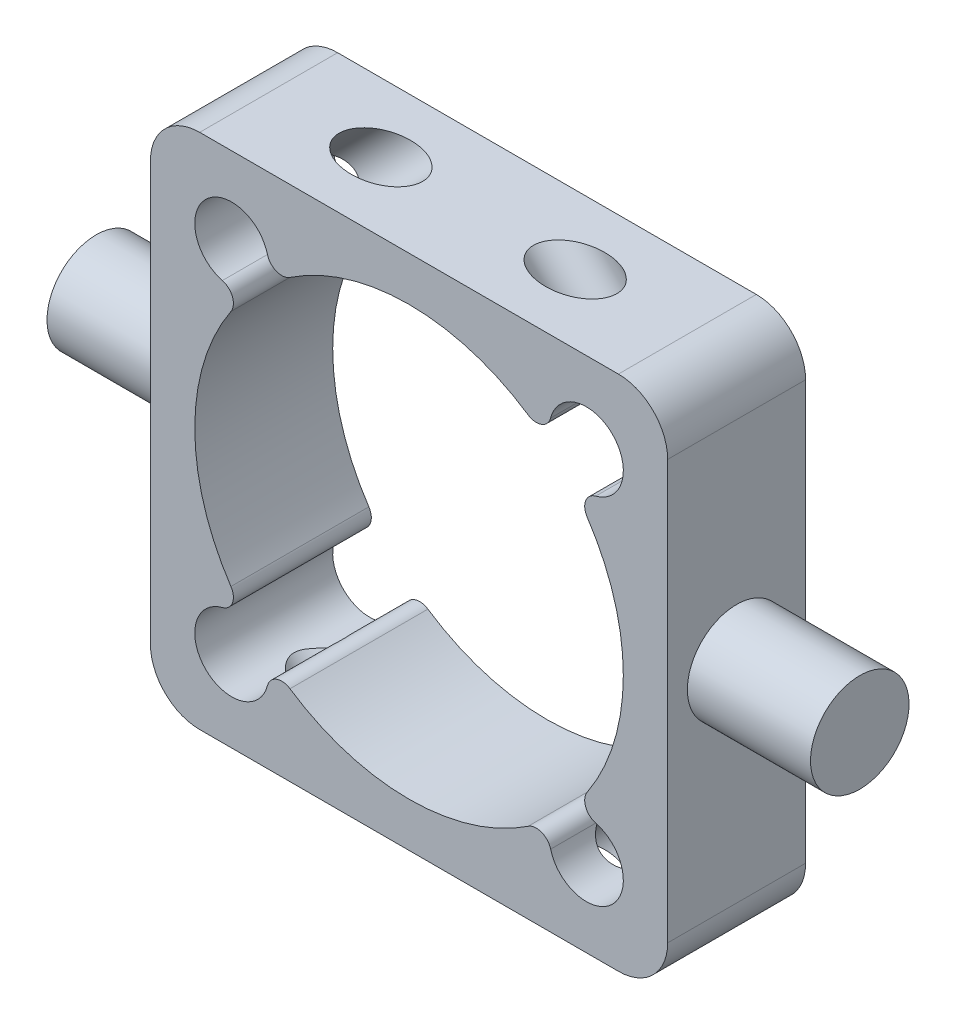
ISO-10303-21;
HEADER;
FILE_DESCRIPTION(('STEP AP214'),'2;1');
FILE_NAME('part.step','',(''),(''),'','','');
FILE_SCHEMA(('AUTOMOTIVE_DESIGN { 1 0 10303 214 1 1 1 1 }'));
ENDSEC;
DATA;
#1=APPLICATION_CONTEXT('core data for automotive mechanical design processes');
#2=APPLICATION_PROTOCOL_DEFINITION('international standard','automotive_design',2000,#1);
#3=PRODUCT_CONTEXT('',#1,'mechanical');
#4=PRODUCT('Part','Part','',(#3));
#5=PRODUCT_RELATED_PRODUCT_CATEGORY('part','',(#4));
#6=PRODUCT_DEFINITION_FORMATION('','',#4);
#7=PRODUCT_DEFINITION_CONTEXT('part definition',#1,'design');
#8=PRODUCT_DEFINITION('design','',#6,#7);
#9=PRODUCT_DEFINITION_SHAPE('','',#8);
#10=(LENGTH_UNIT() NAMED_UNIT(*) SI_UNIT(.MILLI.,.METRE.));
#11=(NAMED_UNIT(*) PLANE_ANGLE_UNIT() SI_UNIT($,.RADIAN.));
#12=(NAMED_UNIT(*) SI_UNIT($,.STERADIAN.) SOLID_ANGLE_UNIT());
#13=UNCERTAINTY_MEASURE_WITH_UNIT(LENGTH_MEASURE(1.E-05),#10,'distance_accuracy_value','');
#14=(GEOMETRIC_REPRESENTATION_CONTEXT(3) GLOBAL_UNCERTAINTY_ASSIGNED_CONTEXT((#13)) GLOBAL_UNIT_ASSIGNED_CONTEXT((#10,
#11,#12)) REPRESENTATION_CONTEXT('',''));
#15=CARTESIAN_POINT('',(0.,0.,0.));
#16=DIRECTION('',(0.,0.,1.));
#17=DIRECTION('',(1.,0.,0.));
#18=AXIS2_PLACEMENT_3D('',#15,#16,#17);
#19=CARTESIAN_POINT('',(-52.5,-52.5,28.));
#20=DIRECTION('',(0.,1.,0.));
#21=DIRECTION('',(-1.,0.,0.));
#22=AXIS2_PLACEMENT_3D('',#19,#20,#21);
#23=PLANE('',#22);
#24=DIRECTION('',(1.,0.,0.));
#25=VECTOR('',#24,1.);
#26=CARTESIAN_POINT('',(-52.5,-52.5,0.));
#27=LINE('',#26,#25);
#28=CARTESIAN_POINT('',(-42.5,-52.5,0.));
#29=VERTEX_POINT('',#28);
#30=CARTESIAN_POINT('',(42.5,-52.5,0.));
#31=VERTEX_POINT('',#30);
#32=EDGE_CURVE('E270',#29,#31,#27,.T.);
#33=ORIENTED_EDGE('',*,*,#32,.T.);
#34=DIRECTION('',(0.,0.,-1.));
#35=VECTOR('',#34,1.);
#36=CARTESIAN_POINT('',(42.5,-52.5,28.));
#37=LINE('',#36,#35);
#38=CARTESIAN_POINT('',(42.5,-52.5,28.));
#39=VERTEX_POINT('',#38);
#40=EDGE_CURVE('E309',#31,#39,#37,.F.);
#41=ORIENTED_EDGE('',*,*,#40,.T.);
#42=DIRECTION('',(1.,0.,0.));
#43=VECTOR('',#42,1.);
#44=CARTESIAN_POINT('',(-52.5,-52.5,28.));
#45=LINE('',#44,#43);
#46=CARTESIAN_POINT('',(-42.5,-52.5,28.));
#47=VERTEX_POINT('',#46);
#48=EDGE_CURVE('E257',#47,#39,#45,.T.);
#49=ORIENTED_EDGE('',*,*,#48,.F.);
#50=DIRECTION('',(0.,0.,-1.));
#51=VECTOR('',#50,1.);
#52=CARTESIAN_POINT('',(-42.5,-52.5,28.));
#53=LINE('',#52,#51);
#54=EDGE_CURVE('E306',#47,#29,#53,.T.);
#55=ORIENTED_EDGE('',*,*,#54,.T.);
#56=EDGE_LOOP('',(#33,#41,#49,#55));
#57=FACE_BOUND('',#56,.T.);
#58=CARTESIAN_POINT('',(19.7253967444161,-52.5,14.));
#59=DIRECTION('',(0.,1.,0.));
#60=DIRECTION('',(-1.,0.,0.));
#61=AXIS2_PLACEMENT_3D('',#58,#59,#60);
#62=ELLIPSE('',#61,8.48528137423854,5.99999999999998);
#63=CARTESIAN_POINT('',(11.2401153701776,-52.5,14.));
#64=VERTEX_POINT('',#63);
#65=EDGE_CURVE('E398',#64,#64,#62,.T.);
#66=ORIENTED_EDGE('',*,*,#65,.T.);
#67=EDGE_LOOP('',(#66));
#68=FACE_BOUND('',#67,.T.);
#69=CARTESIAN_POINT('',(-19.7253967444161,-52.5,14.));
#70=DIRECTION('',(0.,1.,0.));
#71=DIRECTION('',(1.,0.,0.));
#72=AXIS2_PLACEMENT_3D('',#69,#70,#71);
#73=ELLIPSE('',#72,8.48528137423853,5.99999999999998);
#74=CARTESIAN_POINT('',(-11.2401153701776,-52.5,14.));
#75=VERTEX_POINT('',#74);
#76=EDGE_CURVE('E229',#75,#75,#73,.F.);
#77=ORIENTED_EDGE('',*,*,#76,.F.);
#78=EDGE_LOOP('',(#77));
#79=FACE_BOUND('',#78,.T.);
#80=ADVANCED_FACE('F31',(#57,#68,#79),#23,.F.);
#81=CARTESIAN_POINT('',(-36.,-36.,28.));
#82=DIRECTION('',(0.,0.,-1.));
#83=DIRECTION('',(-1.,0.,0.));
#84=AXIS2_PLACEMENT_3D('',#81,#82,#83);
#85=CYLINDRICAL_SURFACE('',#84,7.5);
#86=DIRECTION('',(0.,0.,-1.));
#87=VECTOR('',#86,1.);
#88=CARTESIAN_POINT('',(-28.7442837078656,-37.8985734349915,28.));
#89=LINE('',#88,#87);
#90=CARTESIAN_POINT('',(-28.7442837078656,-37.8985734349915,28.));
#91=VERTEX_POINT('',#90);
#92=CARTESIAN_POINT('',(-28.7442837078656,-37.8985734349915,18.5185867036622));
#93=VERTEX_POINT('',#92);
#94=EDGE_CURVE('E228',#91,#93,#89,.T.);
#95=ORIENTED_EDGE('',*,*,#94,.T.);
#96=CARTESIAN_POINT('',(-28.7442837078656,-37.8985734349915,18.5185867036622));
#97=CARTESIAN_POINT('',(-28.7768899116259,-38.0232183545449,18.6157194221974));
#98=CARTESIAN_POINT('',(-28.8134349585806,-38.1497313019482,18.7092138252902));
#99=CARTESIAN_POINT('',(-28.8950312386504,-38.4057117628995,18.8883741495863));
#100=CARTESIAN_POINT('',(-28.9400906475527,-38.5351820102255,18.9740324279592));
#101=CARTESIAN_POINT('',(-29.0397130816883,-38.7971812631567,19.1374835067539));
#102=CARTESIAN_POINT('',(-29.0943550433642,-38.9297270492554,19.2152017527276));
#103=CARTESIAN_POINT('',(-29.2133342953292,-39.1956814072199,19.3611056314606));
#104=CARTESIAN_POINT('',(-29.2776689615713,-39.3290897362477,19.4292938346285));
#105=CARTESIAN_POINT('',(-29.4168289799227,-39.5964871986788,19.5557251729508));
#106=CARTESIAN_POINT('',(-29.4917204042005,-39.730474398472,19.6139001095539));
#107=CARTESIAN_POINT('',(-29.6517721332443,-39.9967641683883,19.7188600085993));
#108=CARTESIAN_POINT('',(-29.7369307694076,-40.129067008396,19.7656468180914));
#109=CARTESIAN_POINT('',(-29.9169975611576,-40.3900007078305,19.8468561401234));
#110=CARTESIAN_POINT('',(-30.0118656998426,-40.5186440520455,19.8813269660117));
#111=CARTESIAN_POINT('',(-30.211128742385,-40.7712504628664,19.9374867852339));
#112=CARTESIAN_POINT('',(-30.3155218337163,-40.8952144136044,19.9591782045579));
#113=CARTESIAN_POINT('',(-30.5187737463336,-41.1211468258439,19.9873791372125));
#114=CARTESIAN_POINT('',(-30.6165718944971,-41.2238721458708,19.9955026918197));
#115=CARTESIAN_POINT('',(-30.8180033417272,-41.423747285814,20.0016664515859));
#116=CARTESIAN_POINT('',(-30.9216361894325,-41.5208975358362,19.9997074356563));
#117=CARTESIAN_POINT('',(-31.1339415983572,-41.7089050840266,19.9857726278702));
#118=CARTESIAN_POINT('',(-31.2426176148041,-41.799757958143,19.9737898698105));
#119=CARTESIAN_POINT('',(-31.46398138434,-41.9744807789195,19.9400449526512));
#120=CARTESIAN_POINT('',(-31.5766691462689,-42.058350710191,19.9182827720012));
#121=CARTESIAN_POINT('',(-31.7976938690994,-42.2135060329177,19.86707709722));
#122=CARTESIAN_POINT('',(-31.9058426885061,-42.2852542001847,19.8382195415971));
#123=CARTESIAN_POINT('',(-32.1239914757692,-42.422084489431,19.7727010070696));
#124=CARTESIAN_POINT('',(-32.23399208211,-42.487164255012,19.7360372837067));
#125=CARTESIAN_POINT('',(-32.5655765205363,-42.6722286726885,19.6150132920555));
#126=CARTESIAN_POINT('',(-32.7889064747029,-42.7821519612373,19.5195815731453));
#127=CARTESIAN_POINT('',(-33.1630620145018,-42.9447263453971,19.3378537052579));
#128=CARTESIAN_POINT('',(-33.314280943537,-43.0044596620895,19.2583613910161));
#129=CARTESIAN_POINT('',(-33.6148873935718,-43.1124332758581,19.0886519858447));
#130=CARTESIAN_POINT('',(-33.7642743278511,-43.1606699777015,18.9984315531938));
#131=CARTESIAN_POINT('',(-34.0601217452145,-43.2464231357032,18.8081476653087));
#132=CARTESIAN_POINT('',(-34.2065772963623,-43.2839227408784,18.7080690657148));
#133=CARTESIAN_POINT('',(-34.4952330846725,-43.348983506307,18.4989993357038));
#134=CARTESIAN_POINT('',(-34.6374336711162,-43.3765454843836,18.3900089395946));
#135=CARTESIAN_POINT('',(-34.9186613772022,-43.4230265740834,18.1620082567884));
#136=CARTESIAN_POINT('',(-35.0576085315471,-43.4418093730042,18.0428718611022));
#137=CARTESIAN_POINT('',(-35.3289822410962,-43.4711685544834,17.7964194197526));
#138=CARTESIAN_POINT('',(-35.4614080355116,-43.4817439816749,17.6691024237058));
#139=CARTESIAN_POINT('',(-35.718437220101,-43.4958174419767,17.4065160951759));
#140=CARTESIAN_POINT('',(-35.8430431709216,-43.4993178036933,17.2712493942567));
#141=CARTESIAN_POINT('',(-36.0829421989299,-43.500499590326,16.99269930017));
#142=CARTESIAN_POINT('',(-36.1982376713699,-43.4981825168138,16.8494179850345));
#143=CARTESIAN_POINT('',(-36.3884395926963,-43.4903683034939,16.5937124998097));
#144=CARTESIAN_POINT('',(-36.4659439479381,-43.485878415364,16.4831917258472));
#145=CARTESIAN_POINT('',(-36.6138382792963,-43.4752067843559,16.2575674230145));
#146=CARTESIAN_POINT('',(-36.6842268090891,-43.4690246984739,16.1424629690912));
#147=CARTESIAN_POINT('',(-36.8826647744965,-43.4490555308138,15.7904740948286));
#148=CARTESIAN_POINT('',(-36.998411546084,-43.4338212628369,15.5463603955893));
#149=CARTESIAN_POINT('',(-37.1618411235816,-43.4098198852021,15.099618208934));
#150=CARTESIAN_POINT('',(-37.2191071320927,-43.4003733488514,14.9006179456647));
#151=CARTESIAN_POINT('',(-37.2797476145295,-43.390036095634,14.5971348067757));
#152=CARTESIAN_POINT('',(-37.2957499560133,-43.3872294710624,14.4951863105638));
#153=CARTESIAN_POINT('',(-37.3188404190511,-43.383143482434,14.2902727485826));
#154=CARTESIAN_POINT('',(-37.3259321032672,-43.3818635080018,14.1873081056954));
#155=CARTESIAN_POINT('',(-37.3309320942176,-43.3809638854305,13.9807654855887));
#156=CARTESIAN_POINT('',(-37.328806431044,-43.3813503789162,13.8771866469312));
#157=CARTESIAN_POINT('',(-37.3153987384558,-43.3837496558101,13.6706627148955));
#158=CARTESIAN_POINT('',(-37.304116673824,-43.3857624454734,13.5677176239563));
#159=CARTESIAN_POINT('',(-37.2570497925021,-43.3939795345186,13.2607577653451));
#160=CARTESIAN_POINT('',(-37.2080416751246,-43.4023627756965,13.0587610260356));
#161=CARTESIAN_POINT('',(-37.0577788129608,-43.4255318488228,12.5934831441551));
#162=CARTESIAN_POINT('',(-36.9440527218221,-43.4415364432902,12.3343882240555));
#163=CARTESIAN_POINT('',(-36.7447584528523,-43.4632353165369,11.9612703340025));
#164=CARTESIAN_POINT('',(-36.6733663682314,-43.4700953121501,11.839250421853));
#165=CARTESIAN_POINT('',(-36.522428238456,-43.4821645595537,11.600267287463));
#166=CARTESIAN_POINT('',(-36.4428837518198,-43.4873741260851,11.4833031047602));
#167=CARTESIAN_POINT('',(-36.2366152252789,-43.4972811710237,11.1987391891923));
#168=CARTESIAN_POINT('',(-36.1057261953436,-43.5005037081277,11.0341071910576));
#169=CARTESIAN_POINT('',(-35.8317437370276,-43.4993659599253,10.7152935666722));
#170=CARTESIAN_POINT('',(-35.688644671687,-43.4950021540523,10.5611168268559));
#171=CARTESIAN_POINT('',(-35.3925568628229,-43.476831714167,10.2632642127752));
#172=CARTESIAN_POINT('',(-35.2395712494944,-43.4630280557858,10.1195850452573));
#173=CARTESIAN_POINT('',(-34.9255071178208,-43.4243176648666,9.8430364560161));
#174=CARTESIAN_POINT('',(-34.7644312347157,-43.3994145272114,9.71016355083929));
#175=CARTESIAN_POINT('',(-34.4623201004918,-43.342017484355,9.47644960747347));
#176=CARTESIAN_POINT('',(-34.3222478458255,-43.3113982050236,9.37390048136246));
#177=CARTESIAN_POINT('',(-34.0385050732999,-43.2404360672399,9.17753157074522));
#178=CARTESIAN_POINT('',(-33.8948352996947,-43.2000952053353,9.08370999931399));
#179=CARTESIAN_POINT('',(-33.6051213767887,-43.1089791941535,8.90571086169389));
#180=CARTESIAN_POINT('',(-33.4590807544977,-43.0582184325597,8.82152024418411));
#181=CARTESIAN_POINT('',(-33.165628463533,-42.9455756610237,8.66360785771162));
#182=CARTESIAN_POINT('',(-33.0182170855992,-42.8836959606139,8.58988392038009));
#183=CARTESIAN_POINT('',(-32.7507967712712,-42.7609263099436,8.4666080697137));
#184=CARTESIAN_POINT('',(-32.6307857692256,-42.7019889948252,8.41511011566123));
#185=CARTESIAN_POINT('',(-32.3916094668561,-42.5763027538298,8.32037156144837));
#186=CARTESIAN_POINT('',(-32.2724439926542,-42.5095554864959,8.27712921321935));
#187=CARTESIAN_POINT('',(-32.0359004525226,-42.368271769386,8.19949903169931));
#188=CARTESIAN_POINT('',(-31.9185218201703,-42.2937378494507,8.16510833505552));
#189=CARTESIAN_POINT('',(-31.686497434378,-42.1370424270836,8.10570303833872));
#190=CARTESIAN_POINT('',(-31.5718517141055,-42.054880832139,8.08068855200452));
#191=CARTESIAN_POINT('',(-31.3457586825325,-41.8828827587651,8.04038065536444));
#192=CARTESIAN_POINT('',(-31.2343298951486,-41.7930104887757,8.02513570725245));
#193=CARTESIAN_POINT('',(-31.0162800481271,-41.6065243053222,8.00486937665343));
#194=CARTESIAN_POINT('',(-30.9096589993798,-41.5099103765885,7.99984801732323));
#195=CARTESIAN_POINT('',(-30.7021855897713,-41.3107285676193,8.00015896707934));
#196=CARTESIAN_POINT('',(-30.6013321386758,-41.2081618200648,8.00548931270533));
#197=CARTESIAN_POINT('',(-30.4061834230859,-40.9979777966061,8.02643881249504));
#198=CARTESIAN_POINT('',(-30.3118878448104,-40.8903607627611,8.04205747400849));
#199=CARTESIAN_POINT('',(-30.1376055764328,-40.6796926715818,8.08172063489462));
#200=CARTESIAN_POINT('',(-30.0570767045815,-40.5769461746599,8.10500761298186));
#201=CARTESIAN_POINT('',(-29.902442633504,-40.3688251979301,8.15980150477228));
#202=CARTESIAN_POINT('',(-29.828339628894,-40.2634498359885,8.19131121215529));
#203=CARTESIAN_POINT('',(-29.6160210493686,-39.9445976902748,8.29762758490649));
#204=CARTESIAN_POINT('',(-29.4877178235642,-39.7282995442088,8.38423980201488));
#205=CARTESIAN_POINT('',(-29.2498414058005,-39.2794095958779,8.59222574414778));
#206=CARTESIAN_POINT('',(-29.1422202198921,-39.0467417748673,8.71561589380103));
#207=CARTESIAN_POINT('',(-28.9556856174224,-38.586354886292,8.98959792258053));
#208=CARTESIAN_POINT('',(-28.8767506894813,-38.3586322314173,9.14016929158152));
#209=CARTESIAN_POINT('',(-28.786864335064,-38.0561269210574,9.36064710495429));
#210=CARTESIAN_POINT('',(-28.7647899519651,-37.9769670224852,9.42031979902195));
#211=CARTESIAN_POINT('',(-28.7442837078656,-37.8985734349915,9.48141329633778));
#212=B_SPLINE_CURVE_WITH_KNOTS('',3,(#96,#97,#98,#99,#100,#101,#102,#103,#104,#105,#106,#107,
#108,#109,#110,#111,#112,#113,#114,#115,#116,#117,#118,#119,#120,#121,#122,#123,#124,#125,#126,
#127,#128,#129,#130,#131,#132,#133,#134,#135,#136,#137,#138,#139,#140,#141,#142,#143,#144,#145,
#146,#147,#148,#149,#150,#151,#152,#153,#154,#155,#156,#157,#158,#159,#160,#161,#162,#163,#164,
#165,#166,#167,#168,#169,#170,#171,#172,#173,#174,#175,#176,#177,#178,#179,#180,#181,#182,#183,
#184,#185,#186,#187,#188,#189,#190,#191,#192,#193,#194,#195,#196,#197,#198,#199,#200,#201,#202,
#203,#204,#205,#206,#207,#208,#209,#210,#211),.UNSPECIFIED.,.F.,.F.,(4,2,2,2,2,2,2,2,2,2,2,2,2,
2,2,2,2,2,2,2,2,2,2,2,2,2,2,2,2,2,2,2,2,2,2,2,2,2,2,2,2,2,2,2,2,2,2,2,2,2,2,2,2,2,2,2,2,4),(0.,
0.484027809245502,0.968522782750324,1.4572142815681,1.94577371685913,2.43753920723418,
2.92922488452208,3.41896002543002,3.90860216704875,4.33423214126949,4.75982923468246,
5.18572235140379,5.61161640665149,6.01004201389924,6.40860792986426,7.20513777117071,
7.74746911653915,8.28996983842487,8.83331736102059,9.37662015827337,9.92809935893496,
10.4796427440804,11.0310045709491,11.5822240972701,11.9871432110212,12.392144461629,
13.200067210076,13.8192799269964,14.1286316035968,14.4378595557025,14.7482281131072,
15.0585978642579,15.679759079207,16.5250527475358,16.9494476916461,17.3737616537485,
18.0039561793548,18.6344432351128,19.2647316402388,19.8948160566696,20.4231746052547,
20.9514247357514,21.4789503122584,22.0063664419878,22.4357804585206,22.865103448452,
23.294287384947,23.7234765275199,24.1547785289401,24.5860815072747,25.0173026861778,
25.4485032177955,25.8458605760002,26.2433531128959,27.0379687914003,27.8884718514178,
28.738335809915,29.04288493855),.UNSPECIFIED.);
#213=CARTESIAN_POINT('',(-28.7442837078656,-37.8985734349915,9.48141329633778));
#214=VERTEX_POINT('',#213);
#215=EDGE_CURVE('E50',#93,#214,#212,.T.);
#216=ORIENTED_EDGE('',*,*,#215,.T.);
#217=CARTESIAN_POINT('',(-28.7442837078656,-37.8985734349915,0.));
#218=VERTEX_POINT('',#217);
#219=EDGE_CURVE('E226',#214,#218,#89,.T.);
#220=ORIENTED_EDGE('',*,*,#219,.T.);
#221=CARTESIAN_POINT('',(-36.,-36.,0.));
#222=DIRECTION('',(0.,0.,1.));
#223=DIRECTION('',(1.,0.,0.));
#224=AXIS2_PLACEMENT_3D('',#221,#222,#223);
#225=CIRCLE('',#224,7.5);
#226=CARTESIAN_POINT('',(-37.8985734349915,-28.7442837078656,0.));
#227=VERTEX_POINT('',#226);
#228=EDGE_CURVE('E506',#227,#218,#225,.T.);
#229=ORIENTED_EDGE('',*,*,#228,.F.);
#230=DIRECTION('',(0.,0.,-1.));
#231=VECTOR('',#230,1.);
#232=CARTESIAN_POINT('',(-37.8985734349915,-28.7442837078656,28.));
#233=LINE('',#232,#231);
#234=CARTESIAN_POINT('',(-37.8985734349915,-28.7442837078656,28.));
#235=VERTEX_POINT('',#234);
#236=EDGE_CURVE('E237',#235,#227,#233,.T.);
#237=ORIENTED_EDGE('',*,*,#236,.F.);
#238=CARTESIAN_POINT('',(-36.,-36.,28.));
#239=DIRECTION('',(0.,0.,1.));
#240=DIRECTION('',(1.,0.,0.));
#241=AXIS2_PLACEMENT_3D('',#238,#239,#240);
#242=CIRCLE('',#241,7.5);
#243=EDGE_CURVE('E568',#235,#91,#242,.T.);
#244=ORIENTED_EDGE('',*,*,#243,.T.);
#245=EDGE_LOOP('',(#95,#216,#220,#229,#237,#244));
#246=FACE_BOUND('',#245,.T.);
#247=ADVANCED_FACE('F224',(#246),#85,.F.);
#248=CARTESIAN_POINT('',(-25.8419971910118,-38.6580028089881,28.));
#249=DIRECTION('',(0.,0.,-1.));
#250=DIRECTION('',(-1.,0.,0.));
#251=AXIS2_PLACEMENT_3D('',#248,#249,#250);
#252=CYLINDRICAL_SURFACE('',#251,2.99999999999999);
#253=ORIENTED_EDGE('',*,*,#219,.F.);
#254=CARTESIAN_POINT('',(-28.7442837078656,-37.8985734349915,9.48141329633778));
#255=CARTESIAN_POINT('',(-28.731163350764,-37.8484303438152,9.52048904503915));
#256=CARTESIAN_POINT('',(-28.7169628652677,-37.7994682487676,9.56068238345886));
#257=CARTESIAN_POINT('',(-28.6867068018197,-37.7039936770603,9.64318579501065));
#258=CARTESIAN_POINT('',(-28.6706519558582,-37.6574802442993,9.68549502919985));
#259=CARTESIAN_POINT('',(-28.6202497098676,-37.5219644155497,9.81520049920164));
#260=CARTESIAN_POINT('',(-28.5835803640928,-37.4366779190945,9.90561564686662));
#261=CARTESIAN_POINT('',(-28.5068395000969,-37.2772968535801,10.0922408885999));
#262=CARTESIAN_POINT('',(-28.4668170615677,-37.2030739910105,10.1883628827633));
#263=CARTESIAN_POINT('',(-28.3848789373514,-37.0641843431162,10.3866096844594));
#264=CARTESIAN_POINT('',(-28.3429618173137,-36.9995249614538,10.4887390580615));
#265=CARTESIAN_POINT('',(-28.2518826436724,-36.8692056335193,10.7157244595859));
#266=CARTESIAN_POINT('',(-28.2026866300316,-36.8052029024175,10.841515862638));
#267=CARTESIAN_POINT('',(-28.1063057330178,-36.6885790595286,11.098965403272));
#268=CARTESIAN_POINT('',(-28.0591209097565,-36.6359582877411,11.2306237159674));
#269=CARTESIAN_POINT('',(-27.9684353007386,-36.5407876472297,11.4994378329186));
#270=CARTESIAN_POINT('',(-27.9249510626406,-36.4982816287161,11.6366146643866));
#271=CARTESIAN_POINT('',(-27.8434779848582,-36.4225683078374,11.9150901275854));
#272=CARTESIAN_POINT('',(-27.8054891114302,-36.3893609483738,12.0563887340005));
#273=CARTESIAN_POINT('',(-27.7353150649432,-36.3304484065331,12.346521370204));
#274=CARTESIAN_POINT('',(-27.7033326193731,-36.3049916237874,12.4954548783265));
#275=CARTESIAN_POINT('',(-27.647762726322,-36.2620803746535,12.7960148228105));
#276=CARTESIAN_POINT('',(-27.6241752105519,-36.2446258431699,12.9476412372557));
#277=CARTESIAN_POINT('',(-27.5862999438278,-36.2171101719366,13.2524732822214));
#278=CARTESIAN_POINT('',(-27.5719975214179,-36.2070373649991,13.4056760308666));
#279=CARTESIAN_POINT('',(-27.5531716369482,-36.1938572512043,13.7129829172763));
#280=CARTESIAN_POINT('',(-27.5486484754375,-36.1907501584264,13.8670870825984));
#281=CARTESIAN_POINT('',(-27.5495998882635,-36.191405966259,14.1888908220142));
#282=CARTESIAN_POINT('',(-27.5559939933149,-36.1958007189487,14.3565874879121));
#283=CARTESIAN_POINT('',(-27.5802950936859,-36.2128979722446,14.6907265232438));
#284=CARTESIAN_POINT('',(-27.5982031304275,-36.2256012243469,14.8571687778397));
#285=CARTESIAN_POINT('',(-27.6447973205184,-36.259930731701,15.1880677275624));
#286=CARTESIAN_POINT('',(-27.6735124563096,-36.2815809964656,15.3525178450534));
#287=CARTESIAN_POINT('',(-27.7404579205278,-36.3347140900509,15.6778500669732));
#288=CARTESIAN_POINT('',(-27.7786880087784,-36.3661966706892,15.8387322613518));
#289=CARTESIAN_POINT('',(-27.8632842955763,-36.4404397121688,16.156895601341));
#290=CARTESIAN_POINT('',(-27.9097027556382,-36.4832735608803,16.3141458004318));
#291=CARTESIAN_POINT('',(-28.0084191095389,-36.5815952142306,16.6228105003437));
#292=CARTESIAN_POINT('',(-28.0607183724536,-36.6370859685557,16.7742236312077));
#293=CARTESIAN_POINT('',(-28.1682760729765,-36.7619087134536,17.0689122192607));
#294=CARTESIAN_POINT('',(-28.2235136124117,-36.8311505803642,17.2122332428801));
#295=CARTESIAN_POINT('',(-28.3341329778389,-36.985210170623,17.4901578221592));
#296=CARTESIAN_POINT('',(-28.3895146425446,-37.070014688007,17.6247686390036));
#297=CARTESIAN_POINT('',(-28.4722887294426,-37.2140478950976,17.8247321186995));
#298=CARTESIAN_POINT('',(-28.5009804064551,-37.2674250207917,17.8937996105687));
#299=CARTESIAN_POINT('',(-28.5565283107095,-37.3792466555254,18.0284429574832));
#300=CARTESIAN_POINT('',(-28.583385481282,-37.4376885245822,18.0940206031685));
#301=CARTESIAN_POINT('',(-28.6347177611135,-37.5602059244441,18.2219210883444));
#302=CARTESIAN_POINT('',(-28.659169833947,-37.6243264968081,18.2842102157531));
#303=CARTESIAN_POINT('',(-28.7045804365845,-37.7576747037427,18.4046329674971));
#304=CARTESIAN_POINT('',(-28.7255342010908,-37.8269091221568,18.4627608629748));
#305=CARTESIAN_POINT('',(-28.7442837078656,-37.8985734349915,18.5185867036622));
#306=B_SPLINE_CURVE_WITH_KNOTS('',3,(#254,#255,#256,#257,#258,#259,#260,#261,#262,#263,#264,
#265,#266,#267,#268,#269,#270,#271,#272,#273,#274,#275,#276,#277,#278,#279,#280,#281,#282,#283,
#284,#285,#286,#287,#288,#289,#290,#291,#292,#293,#294,#295,#296,#297,#298,#299,#300,#301,#302,
#303,#304,#305),.UNSPECIFIED.,.F.,.F.,(4,2,2,2,2,2,2,2,2,2,2,2,2,2,2,2,2,2,2,2,2,2,2,2,2,4),(0.,
0.194665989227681,0.389255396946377,0.77723935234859,1.16029969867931,1.54365505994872,
1.99142084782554,2.43920000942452,2.88888642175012,3.33857007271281,3.80143315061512,
4.26429246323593,4.7264186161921,5.18855897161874,5.6915689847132,6.19462450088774,
6.69903883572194,7.20344043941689,7.71118619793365,8.21905040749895,8.72368987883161,
9.22790309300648,9.5033661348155,9.77868644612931,10.0564290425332,10.3345469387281),.UNSPECIFIED.);
#307=EDGE_CURVE('E11',#214,#93,#306,.T.);
#308=ORIENTED_EDGE('',*,*,#307,.T.);
#309=ORIENTED_EDGE('',*,*,#94,.F.);
#310=CARTESIAN_POINT('',(-25.8419971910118,-38.6580028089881,28.));
#311=DIRECTION('',(0.,0.,-1.));
#312=DIRECTION('',(1.,0.,0.));
#313=AXIS2_PLACEMENT_3D('',#310,#311,#312);
#314=CIRCLE('',#313,2.99999999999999);
#315=CARTESIAN_POINT('',(-24.1747715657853,-36.1639381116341,28.));
#316=VERTEX_POINT('',#315);
#317=EDGE_CURVE('E575',#91,#316,#314,.T.);
#318=ORIENTED_EDGE('',*,*,#317,.T.);
#319=DIRECTION('',(0.,0.,-1.));
#320=VECTOR('',#319,1.);
#321=CARTESIAN_POINT('',(-24.1747715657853,-36.1639381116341,28.));
#322=LINE('',#321,#320);
#323=CARTESIAN_POINT('',(-24.1747715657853,-36.1639381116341,0.));
#324=VERTEX_POINT('',#323);
#325=EDGE_CURVE('E235',#316,#324,#322,.T.);
#326=ORIENTED_EDGE('',*,*,#325,.T.);
#327=CARTESIAN_POINT('',(-25.8419971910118,-38.6580028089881,0.));
#328=DIRECTION('',(0.,0.,-1.));
#329=DIRECTION('',(1.,0.,0.));
#330=AXIS2_PLACEMENT_3D('',#327,#328,#329);
#331=CIRCLE('',#330,2.99999999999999);
#332=EDGE_CURVE('E233',#218,#324,#331,.T.);
#333=ORIENTED_EDGE('',*,*,#332,.F.);
#334=EDGE_LOOP('',(#253,#308,#309,#318,#326,#333));
#335=FACE_BOUND('',#334,.T.);
#336=ADVANCED_FACE('F231',(#335),#252,.T.);
#337=CARTESIAN_POINT('',(-52.5,52.5,28.));
#338=DIRECTION('',(0.,-1.,0.));
#339=DIRECTION('',(1.,0.,0.));
#340=AXIS2_PLACEMENT_3D('',#337,#338,#339);
#341=PLANE('',#340);
#342=CARTESIAN_POINT('',(-19.7253967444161,52.5,14.));
#343=DIRECTION('',(0.,-1.,0.));
#344=DIRECTION('',(1.,0.,0.));
#345=AXIS2_PLACEMENT_3D('',#342,#343,#344);
#346=ELLIPSE('',#345,8.48528137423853,5.99999999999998);
#347=CARTESIAN_POINT('',(-11.2401153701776,52.5,14.));
#348=VERTEX_POINT('',#347);
#349=EDGE_CURVE('E354',#348,#348,#346,.T.);
#350=ORIENTED_EDGE('',*,*,#349,.T.);
#351=EDGE_LOOP('',(#350));
#352=FACE_BOUND('',#351,.T.);
#353=DIRECTION('',(-1.,0.,0.));
#354=VECTOR('',#353,1.);
#355=CARTESIAN_POINT('',(-52.5,52.5,28.));
#356=LINE('',#355,#354);
#357=CARTESIAN_POINT('',(42.5,52.5,28.));
#358=VERTEX_POINT('',#357);
#359=CARTESIAN_POINT('',(-42.5,52.5,28.));
#360=VERTEX_POINT('',#359);
#361=EDGE_CURVE('E264',#358,#360,#356,.T.);
#362=ORIENTED_EDGE('',*,*,#361,.F.);
#363=DIRECTION('',(0.,0.,-1.));
#364=VECTOR('',#363,1.);
#365=CARTESIAN_POINT('',(42.5,52.5,28.));
#366=LINE('',#365,#364);
#367=CARTESIAN_POINT('',(42.5,52.5,0.));
#368=VERTEX_POINT('',#367);
#369=EDGE_CURVE('E282',#358,#368,#366,.T.);
#370=ORIENTED_EDGE('',*,*,#369,.T.);
#371=DIRECTION('',(-1.,0.,0.));
#372=VECTOR('',#371,1.);
#373=CARTESIAN_POINT('',(-52.5,52.5,0.));
#374=LINE('',#373,#372);
#375=CARTESIAN_POINT('',(-42.5,52.5,0.));
#376=VERTEX_POINT('',#375);
#377=EDGE_CURVE('E258',#368,#376,#374,.T.);
#378=ORIENTED_EDGE('',*,*,#377,.T.);
#379=DIRECTION('',(0.,0.,-1.));
#380=VECTOR('',#379,1.);
#381=CARTESIAN_POINT('',(-42.5,52.5,28.));
#382=LINE('',#381,#380);
#383=EDGE_CURVE('E280',#376,#360,#382,.F.);
#384=ORIENTED_EDGE('',*,*,#383,.T.);
#385=EDGE_LOOP('',(#362,#370,#378,#384));
#386=FACE_BOUND('',#385,.T.);
#387=CARTESIAN_POINT('',(19.7253967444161,52.5,14.));
#388=DIRECTION('',(0.,-1.,0.));
#389=DIRECTION('',(-1.,0.,0.));
#390=AXIS2_PLACEMENT_3D('',#387,#388,#389);
#391=ELLIPSE('',#390,8.48528137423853,5.99999999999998);
#392=CARTESIAN_POINT('',(11.2401153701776,52.5,14.));
#393=VERTEX_POINT('',#392);
#394=EDGE_CURVE('E353',#393,#393,#391,.F.);
#395=ORIENTED_EDGE('',*,*,#394,.F.);
#396=EDGE_LOOP('',(#395));
#397=FACE_BOUND('',#396,.T.);
#398=ADVANCED_FACE('F361',(#352,#386,#397),#341,.F.);
#399=CARTESIAN_POINT('',(36.,36.,28.));
#400=DIRECTION('',(0.,0.,-1.));
#401=DIRECTION('',(-1.,0.,0.));
#402=AXIS2_PLACEMENT_3D('',#399,#400,#401);
#403=CYLINDRICAL_SURFACE('',#402,7.49999999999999);
#404=DIRECTION('',(0.,0.,-1.));
#405=VECTOR('',#404,1.);
#406=CARTESIAN_POINT('',(28.7442837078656,37.8985734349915,28.));
#407=LINE('',#406,#405);
#408=CARTESIAN_POINT('',(28.7442837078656,37.8985734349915,28.));
#409=VERTEX_POINT('',#408);
#410=CARTESIAN_POINT('',(28.7442837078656,37.8985734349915,18.5185867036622));
#411=VERTEX_POINT('',#410);
#412=EDGE_CURVE('E539',#409,#411,#407,.T.);
#413=ORIENTED_EDGE('',*,*,#412,.T.);
#414=CARTESIAN_POINT('',(28.7442837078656,37.8985734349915,18.5185867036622));
#415=CARTESIAN_POINT('',(28.7768899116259,38.0232183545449,18.6157194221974));
#416=CARTESIAN_POINT('',(28.8134349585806,38.1497313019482,18.7092138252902));
#417=CARTESIAN_POINT('',(28.8950312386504,38.4057117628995,18.8883741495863));
#418=CARTESIAN_POINT('',(28.9400906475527,38.5351820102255,18.9740324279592));
#419=CARTESIAN_POINT('',(29.0397130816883,38.7971812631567,19.1374835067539));
#420=CARTESIAN_POINT('',(29.0943550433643,38.9297270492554,19.2152017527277));
#421=CARTESIAN_POINT('',(29.2133342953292,39.19568140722,19.3611056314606));
#422=CARTESIAN_POINT('',(29.2776689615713,39.3290897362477,19.4292938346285));
#423=CARTESIAN_POINT('',(29.4168289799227,39.5964871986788,19.5557251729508));
#424=CARTESIAN_POINT('',(29.4917204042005,39.730474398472,19.613900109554));
#425=CARTESIAN_POINT('',(29.6517721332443,39.9967641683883,19.7188600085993));
#426=CARTESIAN_POINT('',(29.7369307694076,40.129067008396,19.7656468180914));
#427=CARTESIAN_POINT('',(29.9169975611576,40.3900007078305,19.8468561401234));
#428=CARTESIAN_POINT('',(30.0118656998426,40.5186440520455,19.8813269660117));
#429=CARTESIAN_POINT('',(30.211128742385,40.7712504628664,19.9374867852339));
#430=CARTESIAN_POINT('',(30.3155218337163,40.8952144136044,19.9591782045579));
#431=CARTESIAN_POINT('',(30.5187737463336,41.1211468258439,19.9873791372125));
#432=CARTESIAN_POINT('',(30.6165718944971,41.2238721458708,19.9955026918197));
#433=CARTESIAN_POINT('',(30.8180033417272,41.423747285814,20.0016664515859));
#434=CARTESIAN_POINT('',(30.9216361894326,41.5208975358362,19.9997074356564));
#435=CARTESIAN_POINT('',(31.1339415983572,41.7089050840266,19.9857726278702));
#436=CARTESIAN_POINT('',(31.2426176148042,41.799757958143,19.9737898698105));
#437=CARTESIAN_POINT('',(31.46398138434,41.9744807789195,19.9400449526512));
#438=CARTESIAN_POINT('',(31.5766691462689,42.058350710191,19.9182827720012));
#439=CARTESIAN_POINT('',(31.7976938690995,42.2135060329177,19.86707709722));
#440=CARTESIAN_POINT('',(31.9058426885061,42.2852542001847,19.8382195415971));
#441=CARTESIAN_POINT('',(32.1239914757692,42.422084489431,19.7727010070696));
#442=CARTESIAN_POINT('',(32.2339920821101,42.487164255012,19.7360372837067));
#443=CARTESIAN_POINT('',(32.5655765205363,42.6722286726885,19.6150132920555));
#444=CARTESIAN_POINT('',(32.788906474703,42.7821519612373,19.5195815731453));
#445=CARTESIAN_POINT('',(33.1630620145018,42.9447263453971,19.3378537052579));
#446=CARTESIAN_POINT('',(33.314280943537,43.0044596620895,19.2583613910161));
#447=CARTESIAN_POINT('',(33.6148873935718,43.1124332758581,19.0886519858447));
#448=CARTESIAN_POINT('',(33.7642743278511,43.1606699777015,18.9984315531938));
#449=CARTESIAN_POINT('',(34.0601217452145,43.2464231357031,18.8081476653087));
#450=CARTESIAN_POINT('',(34.2065772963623,43.2839227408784,18.7080690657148));
#451=CARTESIAN_POINT('',(34.4952330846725,43.348983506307,18.4989993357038));
#452=CARTESIAN_POINT('',(34.6374336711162,43.3765454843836,18.3900089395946));
#453=CARTESIAN_POINT('',(34.9186613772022,43.4230265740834,18.1620082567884));
#454=CARTESIAN_POINT('',(35.0576085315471,43.4418093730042,18.0428718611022));
#455=CARTESIAN_POINT('',(35.3289822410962,43.4711685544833,17.7964194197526));
#456=CARTESIAN_POINT('',(35.4614080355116,43.4817439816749,17.6691024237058));
#457=CARTESIAN_POINT('',(35.718437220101,43.4958174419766,17.4065160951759));
#458=CARTESIAN_POINT('',(35.8430431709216,43.4993178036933,17.2712493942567));
#459=CARTESIAN_POINT('',(36.0829421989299,43.500499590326,16.99269930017));
#460=CARTESIAN_POINT('',(36.1982376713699,43.4981825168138,16.8494179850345));
#461=CARTESIAN_POINT('',(36.3884395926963,43.4903683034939,16.5937124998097));
#462=CARTESIAN_POINT('',(36.4659439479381,43.485878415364,16.4831917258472));
#463=CARTESIAN_POINT('',(36.6138382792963,43.4752067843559,16.2575674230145));
#464=CARTESIAN_POINT('',(36.6842268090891,43.4690246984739,16.1424629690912));
#465=CARTESIAN_POINT('',(36.8826647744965,43.4490555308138,15.7904740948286));
#466=CARTESIAN_POINT('',(36.998411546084,43.4338212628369,15.5463603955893));
#467=CARTESIAN_POINT('',(37.1618411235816,43.4098198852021,15.099618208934));
#468=CARTESIAN_POINT('',(37.2191071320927,43.4003733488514,14.9006179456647));
#469=CARTESIAN_POINT('',(37.2797476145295,43.390036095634,14.5971348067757));
#470=CARTESIAN_POINT('',(37.2957499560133,43.3872294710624,14.4951863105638));
#471=CARTESIAN_POINT('',(37.3188404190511,43.383143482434,14.2902727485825));
#472=CARTESIAN_POINT('',(37.3259321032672,43.3818635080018,14.1873081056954));
#473=CARTESIAN_POINT('',(37.3309320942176,43.3809638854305,13.9807654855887));
#474=CARTESIAN_POINT('',(37.328806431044,43.3813503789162,13.8771866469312));
#475=CARTESIAN_POINT('',(37.3153987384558,43.3837496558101,13.6706627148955));
#476=CARTESIAN_POINT('',(37.304116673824,43.3857624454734,13.5677176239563));
#477=CARTESIAN_POINT('',(37.2570497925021,43.3939795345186,13.2607577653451));
#478=CARTESIAN_POINT('',(37.2080416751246,43.4023627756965,13.0587610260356));
#479=CARTESIAN_POINT('',(37.0577788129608,43.4255318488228,12.5934831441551));
#480=CARTESIAN_POINT('',(36.9440527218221,43.4415364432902,12.3343882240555));
#481=CARTESIAN_POINT('',(36.7447584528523,43.4632353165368,11.9612703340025));
#482=CARTESIAN_POINT('',(36.6733663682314,43.4700953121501,11.839250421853));
#483=CARTESIAN_POINT('',(36.522428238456,43.4821645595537,11.600267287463));
#484=CARTESIAN_POINT('',(36.4428837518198,43.4873741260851,11.4833031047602));
#485=CARTESIAN_POINT('',(36.2366152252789,43.4972811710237,11.1987391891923));
#486=CARTESIAN_POINT('',(36.1057261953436,43.5005037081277,11.0341071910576));
#487=CARTESIAN_POINT('',(35.8317437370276,43.4993659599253,10.7152935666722));
#488=CARTESIAN_POINT('',(35.688644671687,43.4950021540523,10.5611168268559));
#489=CARTESIAN_POINT('',(35.3925568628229,43.476831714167,10.2632642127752));
#490=CARTESIAN_POINT('',(35.2395712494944,43.4630280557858,10.1195850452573));
#491=CARTESIAN_POINT('',(34.9255071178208,43.4243176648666,9.8430364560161));
#492=CARTESIAN_POINT('',(34.7644312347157,43.3994145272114,9.71016355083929));
#493=CARTESIAN_POINT('',(34.4623201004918,43.342017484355,9.47644960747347));
#494=CARTESIAN_POINT('',(34.3222478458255,43.3113982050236,9.37390048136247));
#495=CARTESIAN_POINT('',(34.0385050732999,43.2404360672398,9.17753157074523));
#496=CARTESIAN_POINT('',(33.8948352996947,43.2000952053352,9.08370999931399));
#497=CARTESIAN_POINT('',(33.6051213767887,43.1089791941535,8.90571086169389));
#498=CARTESIAN_POINT('',(33.4590807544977,43.0582184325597,8.82152024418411));
#499=CARTESIAN_POINT('',(33.165628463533,42.9455756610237,8.66360785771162));
#500=CARTESIAN_POINT('',(33.0182170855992,42.8836959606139,8.58988392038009));
#501=CARTESIAN_POINT('',(32.7507967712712,42.7609263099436,8.46660806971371));
#502=CARTESIAN_POINT('',(32.6307857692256,42.7019889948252,8.41511011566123));
#503=CARTESIAN_POINT('',(32.3916094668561,42.5763027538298,8.32037156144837));
#504=CARTESIAN_POINT('',(32.2724439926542,42.5095554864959,8.27712921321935));
#505=CARTESIAN_POINT('',(32.0359004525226,42.368271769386,8.19949903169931));
#506=CARTESIAN_POINT('',(31.9185218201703,42.2937378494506,8.16510833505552));
#507=CARTESIAN_POINT('',(31.686497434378,42.1370424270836,8.10570303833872));
#508=CARTESIAN_POINT('',(31.5718517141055,42.054880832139,8.08068855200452));
#509=CARTESIAN_POINT('',(31.3457586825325,41.8828827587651,8.04038065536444));
#510=CARTESIAN_POINT('',(31.2343298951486,41.7930104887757,8.02513570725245));
#511=CARTESIAN_POINT('',(31.0162800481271,41.6065243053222,8.00486937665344));
#512=CARTESIAN_POINT('',(30.9096589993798,41.5099103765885,7.99984801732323));
#513=CARTESIAN_POINT('',(30.7021855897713,41.3107285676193,8.00015896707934));
#514=CARTESIAN_POINT('',(30.6013321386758,41.2081618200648,8.00548931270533));
#515=CARTESIAN_POINT('',(30.4061834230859,40.997977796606,8.02643881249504));
#516=CARTESIAN_POINT('',(30.3118878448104,40.890360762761,8.04205747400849));
#517=CARTESIAN_POINT('',(30.1376055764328,40.6796926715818,8.08172063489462));
#518=CARTESIAN_POINT('',(30.0570767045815,40.5769461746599,8.10500761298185));
#519=CARTESIAN_POINT('',(29.902442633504,40.36882519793,8.15980150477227));
#520=CARTESIAN_POINT('',(29.828339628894,40.2634498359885,8.19131121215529));
#521=CARTESIAN_POINT('',(29.6160210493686,39.9445976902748,8.29762758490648));
#522=CARTESIAN_POINT('',(29.4877178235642,39.7282995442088,8.38423980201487));
#523=CARTESIAN_POINT('',(29.2498414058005,39.2794095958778,8.59222574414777));
#524=CARTESIAN_POINT('',(29.1422202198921,39.0467417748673,8.71561589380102));
#525=CARTESIAN_POINT('',(28.9556856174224,38.586354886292,8.98959792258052));
#526=CARTESIAN_POINT('',(28.8767506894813,38.3586322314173,9.14016929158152));
#527=CARTESIAN_POINT('',(28.786864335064,38.0561269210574,9.36064710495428));
#528=CARTESIAN_POINT('',(28.7647899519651,37.9769670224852,9.42031979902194));
#529=CARTESIAN_POINT('',(28.7442837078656,37.8985734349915,9.48141329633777));
#530=B_SPLINE_CURVE_WITH_KNOTS('',3,(#414,#415,#416,#417,#418,#419,#420,#421,#422,#423,#424,
#425,#426,#427,#428,#429,#430,#431,#432,#433,#434,#435,#436,#437,#438,#439,#440,#441,#442,#443,
#444,#445,#446,#447,#448,#449,#450,#451,#452,#453,#454,#455,#456,#457,#458,#459,#460,#461,#462,
#463,#464,#465,#466,#467,#468,#469,#470,#471,#472,#473,#474,#475,#476,#477,#478,#479,#480,#481,
#482,#483,#484,#485,#486,#487,#488,#489,#490,#491,#492,#493,#494,#495,#496,#497,#498,#499,#500,
#501,#502,#503,#504,#505,#506,#507,#508,#509,#510,#511,#512,#513,#514,#515,#516,#517,#518,#519,
#520,#521,#522,#523,#524,#525,#526,#527,#528,#529),.UNSPECIFIED.,.F.,.F.,(4,2,2,2,2,2,2,2,2,2,2,
2,2,2,2,2,2,2,2,2,2,2,2,2,2,2,2,2,2,2,2,2,2,2,2,2,2,2,2,2,2,2,2,2,2,2,2,2,2,2,2,2,2,2,2,2,2,4),
(0.,0.484027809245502,0.968522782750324,1.4572142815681,1.94577371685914,2.43753920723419,
2.92922488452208,3.41896002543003,3.90860216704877,4.33423214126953,4.75982923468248,
5.18572235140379,5.6116164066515,6.01004201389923,6.40860792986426,7.20513777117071,
7.74746911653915,8.28996983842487,8.83331736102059,9.37662015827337,9.92809935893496,
10.4796427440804,11.0310045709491,11.5822240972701,11.9871432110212,12.392144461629,
13.2000672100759,13.8192799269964,14.1286316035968,14.4378595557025,14.7482281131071,
15.0585978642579,15.679759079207,16.5250527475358,16.9494476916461,17.3737616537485,
18.0039561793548,18.6344432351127,19.2647316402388,19.8948160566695,20.4231746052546,
20.9514247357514,21.4789503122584,22.0063664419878,22.4357804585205,22.865103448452,
23.294287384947,23.7234765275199,24.1547785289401,24.5860815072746,25.0173026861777,
25.4485032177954,25.8458605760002,26.2433531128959,27.0379687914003,27.8884718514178,
28.738335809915,29.0428849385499),.UNSPECIFIED.);
#531=CARTESIAN_POINT('',(28.7442837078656,37.8985734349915,9.48141329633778));
#532=VERTEX_POINT('',#531);
#533=EDGE_CURVE('E346',#411,#532,#530,.T.);
#534=ORIENTED_EDGE('',*,*,#533,.T.);
#535=CARTESIAN_POINT('',(28.7442837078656,37.8985734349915,0.));
#536=VERTEX_POINT('',#535);
#537=EDGE_CURVE('E538',#532,#536,#407,.T.);
#538=ORIENTED_EDGE('',*,*,#537,.T.);
#539=CARTESIAN_POINT('',(36.,36.,0.));
#540=DIRECTION('',(0.,0.,1.));
#541=DIRECTION('',(1.,0.,0.));
#542=AXIS2_PLACEMENT_3D('',#539,#540,#541);
#543=CIRCLE('',#542,7.49999999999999);
#544=CARTESIAN_POINT('',(37.8985734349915,28.7442837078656,0.));
#545=VERTEX_POINT('',#544);
#546=EDGE_CURVE('E527',#545,#536,#543,.T.);
#547=ORIENTED_EDGE('',*,*,#546,.F.);
#548=DIRECTION('',(0.,0.,-1.));
#549=VECTOR('',#548,1.);
#550=CARTESIAN_POINT('',(37.8985734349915,28.7442837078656,28.));
#551=LINE('',#550,#549);
#552=CARTESIAN_POINT('',(37.8985734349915,28.7442837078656,28.));
#553=VERTEX_POINT('',#552);
#554=EDGE_CURVE('E542',#553,#545,#551,.T.);
#555=ORIENTED_EDGE('',*,*,#554,.F.);
#556=CARTESIAN_POINT('',(36.,36.,28.));
#557=DIRECTION('',(0.,0.,1.));
#558=DIRECTION('',(1.,0.,0.));
#559=AXIS2_PLACEMENT_3D('',#556,#557,#558);
#560=CIRCLE('',#559,7.49999999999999);
#561=EDGE_CURVE('E593',#553,#409,#560,.T.);
#562=ORIENTED_EDGE('',*,*,#561,.T.);
#563=EDGE_LOOP('',(#413,#534,#538,#547,#555,#562));
#564=FACE_BOUND('',#563,.T.);
#565=ADVANCED_FACE('F357',(#564),#403,.F.);
#566=CARTESIAN_POINT('',(25.8419971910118,38.6580028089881,28.));
#567=DIRECTION('',(0.,0.,-1.));
#568=DIRECTION('',(-1.,0.,0.));
#569=AXIS2_PLACEMENT_3D('',#566,#567,#568);
#570=CYLINDRICAL_SURFACE('',#569,2.99999999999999);
#571=ORIENTED_EDGE('',*,*,#537,.F.);
#572=CARTESIAN_POINT('',(28.7442837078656,37.8985734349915,9.48141329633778));
#573=CARTESIAN_POINT('',(28.731163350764,37.8484303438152,9.52048904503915));
#574=CARTESIAN_POINT('',(28.7169628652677,37.7994682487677,9.56068238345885));
#575=CARTESIAN_POINT('',(28.6867068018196,37.7039936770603,9.64318579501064));
#576=CARTESIAN_POINT('',(28.6706519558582,37.6574802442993,9.68549502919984));
#577=CARTESIAN_POINT('',(28.6202497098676,37.5219644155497,9.81520049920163));
#578=CARTESIAN_POINT('',(28.5835803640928,37.4366779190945,9.90561564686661));
#579=CARTESIAN_POINT('',(28.5068395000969,37.2772968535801,10.0922408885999));
#580=CARTESIAN_POINT('',(28.4668170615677,37.2030739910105,10.1883628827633));
#581=CARTESIAN_POINT('',(28.3848789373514,37.0641843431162,10.3866096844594));
#582=CARTESIAN_POINT('',(28.3429618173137,36.9995249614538,10.4887390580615));
#583=CARTESIAN_POINT('',(28.2518826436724,36.8692056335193,10.7157244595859));
#584=CARTESIAN_POINT('',(28.2026866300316,36.8052029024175,10.8415158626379));
#585=CARTESIAN_POINT('',(28.1063057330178,36.6885790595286,11.0989654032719));
#586=CARTESIAN_POINT('',(28.0591209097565,36.6359582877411,11.2306237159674));
#587=CARTESIAN_POINT('',(27.9684353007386,36.5407876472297,11.4994378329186));
#588=CARTESIAN_POINT('',(27.9249510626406,36.4982816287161,11.6366146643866));
#589=CARTESIAN_POINT('',(27.8434779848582,36.4225683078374,11.9150901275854));
#590=CARTESIAN_POINT('',(27.8054891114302,36.3893609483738,12.0563887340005));
#591=CARTESIAN_POINT('',(27.7353150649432,36.3304484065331,12.346521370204));
#592=CARTESIAN_POINT('',(27.7033326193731,36.3049916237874,12.4954548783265));
#593=CARTESIAN_POINT('',(27.647762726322,36.2620803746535,12.7960148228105));
#594=CARTESIAN_POINT('',(27.6241752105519,36.2446258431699,12.9476412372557));
#595=CARTESIAN_POINT('',(27.5862999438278,36.2171101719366,13.2524732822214));
#596=CARTESIAN_POINT('',(27.5719975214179,36.2070373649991,13.4056760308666));
#597=CARTESIAN_POINT('',(27.5531716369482,36.1938572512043,13.7129829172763));
#598=CARTESIAN_POINT('',(27.5486484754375,36.1907501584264,13.8670870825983));
#599=CARTESIAN_POINT('',(27.5495998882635,36.191405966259,14.1888908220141));
#600=CARTESIAN_POINT('',(27.5559939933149,36.1958007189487,14.3565874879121));
#601=CARTESIAN_POINT('',(27.5802950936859,36.2128979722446,14.6907265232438));
#602=CARTESIAN_POINT('',(27.5982031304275,36.2256012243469,14.8571687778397));
#603=CARTESIAN_POINT('',(27.6447973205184,36.259930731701,15.1880677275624));
#604=CARTESIAN_POINT('',(27.6735124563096,36.2815809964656,15.3525178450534));
#605=CARTESIAN_POINT('',(27.7404579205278,36.3347140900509,15.6778500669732));
#606=CARTESIAN_POINT('',(27.7786880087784,36.3661966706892,15.8387322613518));
#607=CARTESIAN_POINT('',(27.8632842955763,36.4404397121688,16.156895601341));
#608=CARTESIAN_POINT('',(27.9097027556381,36.4832735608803,16.3141458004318));
#609=CARTESIAN_POINT('',(28.0084191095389,36.5815952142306,16.6228105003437));
#610=CARTESIAN_POINT('',(28.0607183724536,36.6370859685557,16.7742236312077));
#611=CARTESIAN_POINT('',(28.1682760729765,36.7619087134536,17.0689122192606));
#612=CARTESIAN_POINT('',(28.2235136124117,36.8311505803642,17.2122332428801));
#613=CARTESIAN_POINT('',(28.3341329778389,36.985210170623,17.4901578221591));
#614=CARTESIAN_POINT('',(28.3895146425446,37.070014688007,17.6247686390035));
#615=CARTESIAN_POINT('',(28.4722887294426,37.2140478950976,17.8247321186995));
#616=CARTESIAN_POINT('',(28.5009804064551,37.2674250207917,17.8937996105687));
#617=CARTESIAN_POINT('',(28.5565283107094,37.3792466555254,18.0284429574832));
#618=CARTESIAN_POINT('',(28.583385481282,37.4376885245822,18.0940206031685));
#619=CARTESIAN_POINT('',(28.6347177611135,37.5602059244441,18.2219210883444));
#620=CARTESIAN_POINT('',(28.6591698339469,37.6243264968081,18.2842102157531));
#621=CARTESIAN_POINT('',(28.7045804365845,37.7576747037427,18.4046329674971));
#622=CARTESIAN_POINT('',(28.7255342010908,37.8269091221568,18.4627608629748));
#623=CARTESIAN_POINT('',(28.7442837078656,37.8985734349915,18.5185867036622));
#624=B_SPLINE_CURVE_WITH_KNOTS('',3,(#572,#573,#574,#575,#576,#577,#578,#579,#580,#581,#582,
#583,#584,#585,#586,#587,#588,#589,#590,#591,#592,#593,#594,#595,#596,#597,#598,#599,#600,#601,
#602,#603,#604,#605,#606,#607,#608,#609,#610,#611,#612,#613,#614,#615,#616,#617,#618,#619,#620,
#621,#622,#623),.UNSPECIFIED.,.F.,.F.,(4,2,2,2,2,2,2,2,2,2,2,2,2,2,2,2,2,2,2,2,2,2,2,2,2,4),(0.,
0.194665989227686,0.389255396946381,0.777239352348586,1.16029969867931,1.54365505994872,
1.99142084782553,2.43920000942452,2.88888642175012,3.33857007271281,3.80143315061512,
4.26429246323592,4.7264186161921,5.18855897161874,5.69156898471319,6.19462450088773,
6.69903883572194,7.20344043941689,7.71118619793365,8.21905040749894,8.7236898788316,
9.22790309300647,9.50336613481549,9.77868644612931,10.0564290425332,10.3345469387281),.UNSPECIFIED.);
#625=EDGE_CURVE('E316',#532,#411,#624,.T.);
#626=ORIENTED_EDGE('',*,*,#625,.T.);
#627=ORIENTED_EDGE('',*,*,#412,.F.);
#628=CARTESIAN_POINT('',(25.8419971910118,38.6580028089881,28.));
#629=DIRECTION('',(0.,0.,-1.));
#630=DIRECTION('',(1.,0.,0.));
#631=AXIS2_PLACEMENT_3D('',#628,#629,#630);
#632=CIRCLE('',#631,2.99999999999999);
#633=CARTESIAN_POINT('',(24.1747715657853,36.1639381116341,28.));
#634=VERTEX_POINT('',#633);
#635=EDGE_CURVE('E594',#409,#634,#632,.T.);
#636=ORIENTED_EDGE('',*,*,#635,.T.);
#637=DIRECTION('',(0.,0.,-1.));
#638=VECTOR('',#637,1.);
#639=CARTESIAN_POINT('',(24.1747715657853,36.1639381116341,28.));
#640=LINE('',#639,#638);
#641=CARTESIAN_POINT('',(24.1747715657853,36.1639381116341,0.));
#642=VERTEX_POINT('',#641);
#643=EDGE_CURVE('E536',#634,#642,#640,.T.);
#644=ORIENTED_EDGE('',*,*,#643,.T.);
#645=CARTESIAN_POINT('',(25.8419971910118,38.6580028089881,0.));
#646=DIRECTION('',(0.,0.,-1.));
#647=DIRECTION('',(1.,0.,0.));
#648=AXIS2_PLACEMENT_3D('',#645,#646,#647);
#649=CIRCLE('',#648,2.99999999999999);
#650=EDGE_CURVE('E530',#536,#642,#649,.T.);
#651=ORIENTED_EDGE('',*,*,#650,.F.);
#652=EDGE_LOOP('',(#571,#626,#627,#636,#644,#651));
#653=FACE_BOUND('',#652,.T.);
#654=ADVANCED_FACE('F330',(#653),#570,.T.);
#655=CARTESIAN_POINT('',(-52.5,52.5,28.));
#656=DIRECTION('',(1.,0.,0.));
#657=DIRECTION('',(0.,1.,0.));
#658=AXIS2_PLACEMENT_3D('',#655,#656,#657);
#659=PLANE('',#658);
#660=DIRECTION('',(0.,-1.,0.));
#661=VECTOR('',#660,1.);
#662=CARTESIAN_POINT('',(-52.5,52.5,0.));
#663=LINE('',#662,#661);
#664=CARTESIAN_POINT('',(-52.5,42.5,0.));
#665=VERTEX_POINT('',#664);
#666=CARTESIAN_POINT('',(-52.5,-42.5,0.));
#667=VERTEX_POINT('',#666);
#668=EDGE_CURVE('E253',#665,#667,#663,.T.);
#669=ORIENTED_EDGE('',*,*,#668,.T.);
#670=DIRECTION('',(0.,0.,-1.));
#671=VECTOR('',#670,1.);
#672=CARTESIAN_POINT('',(-52.5,-42.5,28.));
#673=LINE('',#672,#671);
#674=CARTESIAN_POINT('',(-52.5,-42.5,28.));
#675=VERTEX_POINT('',#674);
#676=EDGE_CURVE('E314',#667,#675,#673,.F.);
#677=ORIENTED_EDGE('',*,*,#676,.T.);
#678=DIRECTION('',(0.,-1.,0.));
#679=VECTOR('',#678,1.);
#680=CARTESIAN_POINT('',(-52.5,52.5,28.));
#681=LINE('',#680,#679);
#682=CARTESIAN_POINT('',(-52.5,42.5,28.));
#683=VERTEX_POINT('',#682);
#684=EDGE_CURVE('E254',#683,#675,#681,.T.);
#685=ORIENTED_EDGE('',*,*,#684,.F.);
#686=DIRECTION('',(0.,0.,-1.));
#687=VECTOR('',#686,1.);
#688=CARTESIAN_POINT('',(-52.5,42.5,28.));
#689=LINE('',#688,#687);
#690=EDGE_CURVE('E311',#683,#665,#689,.T.);
#691=ORIENTED_EDGE('',*,*,#690,.T.);
#692=EDGE_LOOP('',(#669,#677,#685,#691));
#693=FACE_BOUND('',#692,.T.);
#694=CARTESIAN_POINT('',(-52.5,0.,14.));
#695=DIRECTION('',(1.,0.,0.));
#696=DIRECTION('',(0.,1.,0.));
#697=AXIS2_PLACEMENT_3D('',#694,#695,#696);
#698=CIRCLE('',#697,10.);
#699=CARTESIAN_POINT('',(-52.5,9.99999999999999,14.));
#700=VERTEX_POINT('',#699);
#701=EDGE_CURVE('E267',#700,#700,#698,.F.);
#702=ORIENTED_EDGE('',*,*,#701,.F.);
#703=EDGE_LOOP('',(#702));
#704=FACE_BOUND('',#703,.T.);
#705=ADVANCED_FACE('F418',(#693,#704),#659,.F.);
#706=CARTESIAN_POINT('',(-52.5,-52.5,28.));
#707=DIRECTION('',(0.,0.,1.));
#708=DIRECTION('',(1.,0.,0.));
#709=AXIS2_PLACEMENT_3D('',#706,#707,#708);
#710=PLANE('',#709);
#711=DIRECTION('',(0.,1.,0.));
#712=VECTOR('',#711,1.);
#713=CARTESIAN_POINT('',(52.5,52.5,28.));
#714=LINE('',#713,#712);
#715=CARTESIAN_POINT('',(52.5,-42.5,28.));
#716=VERTEX_POINT('',#715);
#717=CARTESIAN_POINT('',(52.5,42.5,28.));
#718=VERTEX_POINT('',#717);
#719=EDGE_CURVE('E261',#716,#718,#714,.T.);
#720=ORIENTED_EDGE('',*,*,#719,.T.);
#721=CARTESIAN_POINT('',(42.5,42.5,28.));
#722=DIRECTION('',(0.,0.,1.));
#723=DIRECTION('',(1.,0.,0.));
#724=AXIS2_PLACEMENT_3D('',#721,#722,#723);
#725=CIRCLE('',#724,10.);
#726=EDGE_CURVE('E304',#718,#358,#725,.T.);
#727=ORIENTED_EDGE('',*,*,#726,.T.);
#728=ORIENTED_EDGE('',*,*,#361,.T.);
#729=CARTESIAN_POINT('',(-42.5,42.5,28.));
#730=DIRECTION('',(0.,0.,1.));
#731=DIRECTION('',(1.,0.,0.));
#732=AXIS2_PLACEMENT_3D('',#729,#730,#731);
#733=CIRCLE('',#732,10.);
#734=EDGE_CURVE('E298',#360,#683,#733,.T.);
#735=ORIENTED_EDGE('',*,*,#734,.T.);
#736=ORIENTED_EDGE('',*,*,#684,.T.);
#737=CARTESIAN_POINT('',(-42.5,-42.5,28.));
#738=DIRECTION('',(0.,0.,1.));
#739=DIRECTION('',(1.,0.,0.));
#740=AXIS2_PLACEMENT_3D('',#737,#738,#739);
#741=CIRCLE('',#740,10.);
#742=EDGE_CURVE('E300',#675,#47,#741,.T.);
#743=ORIENTED_EDGE('',*,*,#742,.T.);
#744=ORIENTED_EDGE('',*,*,#48,.T.);
#745=CARTESIAN_POINT('',(42.5,-42.5,28.));
#746=DIRECTION('',(0.,0.,1.));
#747=DIRECTION('',(1.,0.,0.));
#748=AXIS2_PLACEMENT_3D('',#745,#746,#747);
#749=CIRCLE('',#748,10.);
#750=EDGE_CURVE('E302',#39,#716,#749,.T.);
#751=ORIENTED_EDGE('',*,*,#750,.T.);
#752=EDGE_LOOP('',(#720,#727,#728,#735,#736,#743,#744,#751));
#753=FACE_BOUND('',#752,.T.);
#754=CARTESIAN_POINT('',(-36.,36.,28.));
#755=DIRECTION('',(0.,0.,1.));
#756=DIRECTION('',(1.,0.,0.));
#757=AXIS2_PLACEMENT_3D('',#754,#755,#756);
#758=CIRCLE('',#757,7.5);
#759=CARTESIAN_POINT('',(-28.7442837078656,37.8985734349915,28.));
#760=VERTEX_POINT('',#759);
#761=CARTESIAN_POINT('',(-37.8985734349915,28.7442837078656,28.));
#762=VERTEX_POINT('',#761);
#763=EDGE_CURVE('E605',#760,#762,#758,.T.);
#764=ORIENTED_EDGE('',*,*,#763,.F.);
#765=CARTESIAN_POINT('',(-25.8419971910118,38.6580028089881,28.));
#766=DIRECTION('',(0.,0.,-1.));
#767=DIRECTION('',(1.,0.,0.));
#768=AXIS2_PLACEMENT_3D('',#765,#766,#767);
#769=CIRCLE('',#768,2.99999999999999);
#770=CARTESIAN_POINT('',(-24.1747715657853,36.1639381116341,28.));
#771=VERTEX_POINT('',#770);
#772=EDGE_CURVE('E533',#771,#760,#769,.T.);
#773=ORIENTED_EDGE('',*,*,#772,.F.);
#774=CARTESIAN_POINT('',(0.,0.,28.));
#775=DIRECTION('',(0.,0.,1.));
#776=DIRECTION('',(1.,0.,0.));
#777=AXIS2_PLACEMENT_3D('',#774,#775,#776);
#778=CIRCLE('',#777,43.5);
#779=EDGE_CURVE('E496',#634,#771,#778,.T.);
#780=ORIENTED_EDGE('',*,*,#779,.F.);
#781=ORIENTED_EDGE('',*,*,#635,.F.);
#782=ORIENTED_EDGE('',*,*,#561,.F.);
#783=CARTESIAN_POINT('',(38.6580028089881,25.8419971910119,28.));
#784=DIRECTION('',(0.,0.,-1.));
#785=DIRECTION('',(-1.,0.,0.));
#786=AXIS2_PLACEMENT_3D('',#783,#784,#785);
#787=CIRCLE('',#786,2.99999999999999);
#788=CARTESIAN_POINT('',(36.163938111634,24.1747715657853,28.));
#789=VERTEX_POINT('',#788);
#790=EDGE_CURVE('E591',#789,#553,#787,.T.);
#791=ORIENTED_EDGE('',*,*,#790,.F.);
#792=CARTESIAN_POINT('',(0.,0.,28.));
#793=DIRECTION('',(0.,0.,1.));
#794=DIRECTION('',(1.,0.,0.));
#795=AXIS2_PLACEMENT_3D('',#792,#793,#794);
#796=CIRCLE('',#795,43.5);
#797=CARTESIAN_POINT('',(36.1639381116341,-24.1747715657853,28.));
#798=VERTEX_POINT('',#797);
#799=EDGE_CURVE('E589',#798,#789,#796,.T.);
#800=ORIENTED_EDGE('',*,*,#799,.F.);
#801=CARTESIAN_POINT('',(38.6580028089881,-25.8419971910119,28.));
#802=DIRECTION('',(0.,0.,-1.));
#803=DIRECTION('',(1.,0.,0.));
#804=AXIS2_PLACEMENT_3D('',#801,#802,#803);
#805=CIRCLE('',#804,2.99999999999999);
#806=CARTESIAN_POINT('',(37.8985734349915,-28.7442837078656,28.));
#807=VERTEX_POINT('',#806);
#808=EDGE_CURVE('E587',#807,#798,#805,.T.);
#809=ORIENTED_EDGE('',*,*,#808,.F.);
#810=CARTESIAN_POINT('',(36.,-36.,28.));
#811=DIRECTION('',(0.,0.,1.));
#812=DIRECTION('',(1.,0.,0.));
#813=AXIS2_PLACEMENT_3D('',#810,#811,#812);
#814=CIRCLE('',#813,7.5);
#815=CARTESIAN_POINT('',(28.7442837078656,-37.8985734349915,28.));
#816=VERTEX_POINT('',#815);
#817=EDGE_CURVE('E585',#816,#807,#814,.T.);
#818=ORIENTED_EDGE('',*,*,#817,.F.);
#819=CARTESIAN_POINT('',(25.8419971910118,-38.6580028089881,28.));
#820=DIRECTION('',(0.,0.,-1.));
#821=DIRECTION('',(-1.,0.,0.));
#822=AXIS2_PLACEMENT_3D('',#819,#820,#821);
#823=CIRCLE('',#822,2.99999999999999);
#824=CARTESIAN_POINT('',(24.1747715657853,-36.1639381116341,28.));
#825=VERTEX_POINT('',#824);
#826=EDGE_CURVE('E583',#825,#816,#823,.T.);
#827=ORIENTED_EDGE('',*,*,#826,.F.);
#828=CARTESIAN_POINT('',(0.,0.,28.));
#829=DIRECTION('',(0.,0.,1.));
#830=DIRECTION('',(1.,0.,0.));
#831=AXIS2_PLACEMENT_3D('',#828,#829,#830);
#832=CIRCLE('',#831,43.5);
#833=EDGE_CURVE('E560',#316,#825,#832,.T.);
#834=ORIENTED_EDGE('',*,*,#833,.F.);
#835=ORIENTED_EDGE('',*,*,#317,.F.);
#836=ORIENTED_EDGE('',*,*,#243,.F.);
#837=CARTESIAN_POINT('',(-38.6580028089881,-25.8419971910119,28.));
#838=DIRECTION('',(0.,0.,-1.));
#839=DIRECTION('',(1.,0.,0.));
#840=AXIS2_PLACEMENT_3D('',#837,#838,#839);
#841=CIRCLE('',#840,2.99999999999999);
#842=CARTESIAN_POINT('',(-36.1639381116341,-24.1747715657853,28.));
#843=VERTEX_POINT('',#842);
#844=EDGE_CURVE('E574',#843,#235,#841,.T.);
#845=ORIENTED_EDGE('',*,*,#844,.F.);
#846=CARTESIAN_POINT('',(0.,0.,28.));
#847=DIRECTION('',(0.,0.,1.));
#848=DIRECTION('',(1.,0.,0.));
#849=AXIS2_PLACEMENT_3D('',#846,#847,#848);
#850=CIRCLE('',#849,43.5);
#851=CARTESIAN_POINT('',(-36.1639381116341,24.1747715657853,28.));
#852=VERTEX_POINT('',#851);
#853=EDGE_CURVE('E578',#852,#843,#850,.T.);
#854=ORIENTED_EDGE('',*,*,#853,.F.);
#855=CARTESIAN_POINT('',(-38.6580028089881,25.8419971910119,28.));
#856=DIRECTION('',(0.,0.,-1.));
#857=DIRECTION('',(1.,0.,0.));
#858=AXIS2_PLACEMENT_3D('',#855,#856,#857);
#859=CIRCLE('',#858,2.99999999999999);
#860=EDGE_CURVE('E607',#762,#852,#859,.T.);
#861=ORIENTED_EDGE('',*,*,#860,.F.);
#862=EDGE_LOOP('',(#764,#773,#780,#781,#782,#791,#800,#809,#818,#827,#834,#835,#836,#845,#854,#861));
#863=FACE_BOUND('',#862,.T.);
#864=ADVANCED_FACE('F414',(#753,#863),#710,.T.);
#865=CARTESIAN_POINT('',(-52.5,-52.5,0.));
#866=DIRECTION('',(0.,0.,1.));
#867=DIRECTION('',(1.,0.,0.));
#868=AXIS2_PLACEMENT_3D('',#865,#866,#867);
#869=PLANE('',#868);
#870=ORIENTED_EDGE('',*,*,#377,.F.);
#871=CARTESIAN_POINT('',(42.5,42.5,0.));
#872=DIRECTION('',(0.,0.,1.));
#873=DIRECTION('',(1.,0.,0.));
#874=AXIS2_PLACEMENT_3D('',#871,#872,#873);
#875=CIRCLE('',#874,10.);
#876=CARTESIAN_POINT('',(52.5,42.5,0.));
#877=VERTEX_POINT('',#876);
#878=EDGE_CURVE('E291',#368,#877,#875,.F.);
#879=ORIENTED_EDGE('',*,*,#878,.T.);
#880=DIRECTION('',(0.,1.,0.));
#881=VECTOR('',#880,1.);
#882=CARTESIAN_POINT('',(52.5,52.5,0.));
#883=LINE('',#882,#881);
#884=CARTESIAN_POINT('',(52.5,-42.5,0.));
#885=VERTEX_POINT('',#884);
#886=EDGE_CURVE('E273',#885,#877,#883,.T.);
#887=ORIENTED_EDGE('',*,*,#886,.F.);
#888=CARTESIAN_POINT('',(42.5,-42.5,0.));
#889=DIRECTION('',(0.,0.,1.));
#890=DIRECTION('',(1.,0.,0.));
#891=AXIS2_PLACEMENT_3D('',#888,#889,#890);
#892=CIRCLE('',#891,10.);
#893=EDGE_CURVE('E289',#885,#31,#892,.F.);
#894=ORIENTED_EDGE('',*,*,#893,.T.);
#895=ORIENTED_EDGE('',*,*,#32,.F.);
#896=CARTESIAN_POINT('',(-42.5,-42.5,0.));
#897=DIRECTION('',(0.,0.,1.));
#898=DIRECTION('',(1.,0.,0.));
#899=AXIS2_PLACEMENT_3D('',#896,#897,#898);
#900=CIRCLE('',#899,10.);
#901=EDGE_CURVE('E287',#29,#667,#900,.F.);
#902=ORIENTED_EDGE('',*,*,#901,.T.);
#903=ORIENTED_EDGE('',*,*,#668,.F.);
#904=CARTESIAN_POINT('',(-42.5,42.5,0.));
#905=DIRECTION('',(0.,0.,1.));
#906=DIRECTION('',(1.,0.,0.));
#907=AXIS2_PLACEMENT_3D('',#904,#905,#906);
#908=CIRCLE('',#907,10.);
#909=EDGE_CURVE('E285',#665,#376,#908,.F.);
#910=ORIENTED_EDGE('',*,*,#909,.T.);
#911=EDGE_LOOP('',(#870,#879,#887,#894,#895,#902,#903,#910));
#912=FACE_BOUND('',#911,.T.);
#913=CARTESIAN_POINT('',(-25.8419971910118,38.6580028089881,0.));
#914=DIRECTION('',(0.,0.,-1.));
#915=DIRECTION('',(1.,0.,0.));
#916=AXIS2_PLACEMENT_3D('',#913,#914,#915);
#917=CIRCLE('',#916,2.99999999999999);
#918=CARTESIAN_POINT('',(-24.1747715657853,36.1639381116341,0.));
#919=VERTEX_POINT('',#918);
#920=CARTESIAN_POINT('',(-28.7442837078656,37.8985734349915,0.));
#921=VERTEX_POINT('',#920);
#922=EDGE_CURVE('E479',#919,#921,#917,.T.);
#923=ORIENTED_EDGE('',*,*,#922,.T.);
#924=CARTESIAN_POINT('',(-36.,36.,0.));
#925=DIRECTION('',(0.,0.,1.));
#926=DIRECTION('',(1.,0.,0.));
#927=AXIS2_PLACEMENT_3D('',#924,#925,#926);
#928=CIRCLE('',#927,7.5);
#929=CARTESIAN_POINT('',(-37.8985734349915,28.7442837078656,0.));
#930=VERTEX_POINT('',#929);
#931=EDGE_CURVE('E482',#921,#930,#928,.T.);
#932=ORIENTED_EDGE('',*,*,#931,.T.);
#933=CARTESIAN_POINT('',(-38.6580028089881,25.8419971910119,0.));
#934=DIRECTION('',(0.,0.,-1.));
#935=DIRECTION('',(1.,0.,0.));
#936=AXIS2_PLACEMENT_3D('',#933,#934,#935);
#937=CIRCLE('',#936,2.99999999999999);
#938=CARTESIAN_POINT('',(-36.1639381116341,24.1747715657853,0.));
#939=VERTEX_POINT('',#938);
#940=EDGE_CURVE('E490',#930,#939,#937,.T.);
#941=ORIENTED_EDGE('',*,*,#940,.T.);
#942=CARTESIAN_POINT('',(0.,0.,0.));
#943=DIRECTION('',(0.,0.,1.));
#944=DIRECTION('',(1.,0.,0.));
#945=AXIS2_PLACEMENT_3D('',#942,#943,#944);
#946=CIRCLE('',#945,43.5);
#947=CARTESIAN_POINT('',(-36.1639381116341,-24.1747715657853,0.));
#948=VERTEX_POINT('',#947);
#949=EDGE_CURVE('E500',#939,#948,#946,.T.);
#950=ORIENTED_EDGE('',*,*,#949,.T.);
#951=CARTESIAN_POINT('',(-38.6580028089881,-25.8419971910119,0.));
#952=DIRECTION('',(0.,0.,-1.));
#953=DIRECTION('',(1.,0.,0.));
#954=AXIS2_PLACEMENT_3D('',#951,#952,#953);
#955=CIRCLE('',#954,2.99999999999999);
#956=EDGE_CURVE('E503',#948,#227,#955,.T.);
#957=ORIENTED_EDGE('',*,*,#956,.T.);
#958=ORIENTED_EDGE('',*,*,#228,.T.);
#959=ORIENTED_EDGE('',*,*,#332,.T.);
#960=CARTESIAN_POINT('',(0.,0.,0.));
#961=DIRECTION('',(0.,0.,1.));
#962=DIRECTION('',(1.,0.,0.));
#963=AXIS2_PLACEMENT_3D('',#960,#961,#962);
#964=CIRCLE('',#963,43.5);
#965=CARTESIAN_POINT('',(24.1747715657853,-36.1639381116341,0.));
#966=VERTEX_POINT('',#965);
#967=EDGE_CURVE('E509',#324,#966,#964,.T.);
#968=ORIENTED_EDGE('',*,*,#967,.T.);
#969=CARTESIAN_POINT('',(25.8419971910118,-38.6580028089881,0.));
#970=DIRECTION('',(0.,0.,-1.));
#971=DIRECTION('',(-1.,0.,0.));
#972=AXIS2_PLACEMENT_3D('',#969,#970,#971);
#973=CIRCLE('',#972,2.99999999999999);
#974=CARTESIAN_POINT('',(28.7442837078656,-37.8985734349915,0.));
#975=VERTEX_POINT('',#974);
#976=EDGE_CURVE('E512',#966,#975,#973,.T.);
#977=ORIENTED_EDGE('',*,*,#976,.T.);
#978=CARTESIAN_POINT('',(36.,-36.,0.));
#979=DIRECTION('',(0.,0.,1.));
#980=DIRECTION('',(1.,0.,0.));
#981=AXIS2_PLACEMENT_3D('',#978,#979,#980);
#982=CIRCLE('',#981,7.5);
#983=CARTESIAN_POINT('',(37.8985734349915,-28.7442837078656,0.));
#984=VERTEX_POINT('',#983);
#985=EDGE_CURVE('E515',#975,#984,#982,.T.);
#986=ORIENTED_EDGE('',*,*,#985,.T.);
#987=CARTESIAN_POINT('',(38.6580028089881,-25.8419971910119,0.));
#988=DIRECTION('',(0.,0.,-1.));
#989=DIRECTION('',(1.,0.,0.));
#990=AXIS2_PLACEMENT_3D('',#987,#988,#989);
#991=CIRCLE('',#990,2.99999999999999);
#992=CARTESIAN_POINT('',(36.1639381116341,-24.1747715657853,0.));
#993=VERTEX_POINT('',#992);
#994=EDGE_CURVE('E518',#984,#993,#991,.T.);
#995=ORIENTED_EDGE('',*,*,#994,.T.);
#996=CARTESIAN_POINT('',(0.,0.,0.));
#997=DIRECTION('',(0.,0.,1.));
#998=DIRECTION('',(1.,0.,0.));
#999=AXIS2_PLACEMENT_3D('',#996,#997,#998);
#1000=CIRCLE('',#999,43.5);
#1001=CARTESIAN_POINT('',(36.163938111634,24.1747715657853,0.));
#1002=VERTEX_POINT('',#1001);
#1003=EDGE_CURVE('E521',#993,#1002,#1000,.T.);
#1004=ORIENTED_EDGE('',*,*,#1003,.T.);
#1005=CARTESIAN_POINT('',(38.6580028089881,25.8419971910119,0.));
#1006=DIRECTION('',(0.,0.,-1.));
#1007=DIRECTION('',(-1.,0.,0.));
#1008=AXIS2_PLACEMENT_3D('',#1005,#1006,#1007);
#1009=CIRCLE('',#1008,2.99999999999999);
#1010=EDGE_CURVE('E524',#1002,#545,#1009,.T.);
#1011=ORIENTED_EDGE('',*,*,#1010,.T.);
#1012=ORIENTED_EDGE('',*,*,#546,.T.);
#1013=ORIENTED_EDGE('',*,*,#650,.T.);
#1014=CARTESIAN_POINT('',(0.,0.,0.));
#1015=DIRECTION('',(0.,0.,1.));
#1016=DIRECTION('',(1.,0.,0.));
#1017=AXIS2_PLACEMENT_3D('',#1014,#1015,#1016);
#1018=CIRCLE('',#1017,43.5);
#1019=EDGE_CURVE('E485',#642,#919,#1018,.T.);
#1020=ORIENTED_EDGE('',*,*,#1019,.T.);
#1021=EDGE_LOOP('',(#923,#932,#941,#950,#957,#958,#959,#968,#977,#986,#995,#1004,#1011,#1012,
#1013,#1020));
#1022=FACE_BOUND('',#1021,.T.);
#1023=ADVANCED_FACE('F417',(#912,#1022),#869,.F.);
#1024=CARTESIAN_POINT('',(52.5,52.5,28.));
#1025=DIRECTION('',(-1.,0.,0.));
#1026=DIRECTION('',(0.,-1.,0.));
#1027=AXIS2_PLACEMENT_3D('',#1024,#1025,#1026);
#1028=PLANE('',#1027);
#1029=CARTESIAN_POINT('',(52.5,0.,14.));
#1030=DIRECTION('',(-1.,0.,0.));
#1031=DIRECTION('',(0.,-1.,0.));
#1032=AXIS2_PLACEMENT_3D('',#1029,#1030,#1031);
#1033=CIRCLE('',#1032,10.);
#1034=CARTESIAN_POINT('',(52.5,-10.,14.));
#1035=VERTEX_POINT('',#1034);
#1036=EDGE_CURVE('E870',#1035,#1035,#1033,.T.);
#1037=ORIENTED_EDGE('',*,*,#1036,.T.);
#1038=EDGE_LOOP('',(#1037));
#1039=FACE_BOUND('',#1038,.T.);
#1040=ORIENTED_EDGE('',*,*,#886,.T.);
#1041=DIRECTION('',(0.,0.,-1.));
#1042=VECTOR('',#1041,1.);
#1043=CARTESIAN_POINT('',(52.5,42.5,28.));
#1044=LINE('',#1043,#1042);
#1045=EDGE_CURVE('E296',#877,#718,#1044,.F.);
#1046=ORIENTED_EDGE('',*,*,#1045,.T.);
#1047=ORIENTED_EDGE('',*,*,#719,.F.);
#1048=DIRECTION('',(0.,0.,-1.));
#1049=VECTOR('',#1048,1.);
#1050=CARTESIAN_POINT('',(52.5,-42.5,28.));
#1051=LINE('',#1050,#1049);
#1052=EDGE_CURVE('E293',#716,#885,#1051,.T.);
#1053=ORIENTED_EDGE('',*,*,#1052,.T.);
#1054=EDGE_LOOP('',(#1040,#1046,#1047,#1053));
#1055=FACE_BOUND('',#1054,.T.);
#1056=ADVANCED_FACE('F410',(#1039,#1055),#1028,.F.);
#1057=CARTESIAN_POINT('',(-25.8419971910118,38.6580028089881,28.));
#1058=DIRECTION('',(0.,0.,-1.));
#1059=DIRECTION('',(-1.,0.,0.));
#1060=AXIS2_PLACEMENT_3D('',#1057,#1058,#1059);
#1061=CYLINDRICAL_SURFACE('',#1060,2.99999999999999);
#1062=CARTESIAN_POINT('',(-28.7442837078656,37.8985734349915,9.48141329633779));
#1063=CARTESIAN_POINT('',(-28.731163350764,37.8484303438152,9.52048904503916));
#1064=CARTESIAN_POINT('',(-28.7169628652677,37.7994682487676,9.56068238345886));
#1065=CARTESIAN_POINT('',(-28.6867068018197,37.7039936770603,9.64318579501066));
#1066=CARTESIAN_POINT('',(-28.6706519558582,37.6574802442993,9.68549502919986));
#1067=CARTESIAN_POINT('',(-28.6202497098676,37.5219644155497,9.81520049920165));
#1068=CARTESIAN_POINT('',(-28.5835803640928,37.4366779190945,9.90561564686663));
#1069=CARTESIAN_POINT('',(-28.5068395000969,37.2772968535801,10.0922408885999));
#1070=CARTESIAN_POINT('',(-28.4668170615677,37.2030739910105,10.1883628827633));
#1071=CARTESIAN_POINT('',(-28.3848789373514,37.0641843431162,10.3866096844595));
#1072=CARTESIAN_POINT('',(-28.3429618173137,36.9995249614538,10.4887390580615));
#1073=CARTESIAN_POINT('',(-28.2518826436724,36.8692056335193,10.7157244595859));
#1074=CARTESIAN_POINT('',(-28.2026866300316,36.8052029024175,10.841515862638));
#1075=CARTESIAN_POINT('',(-28.1063057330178,36.6885790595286,11.098965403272));
#1076=CARTESIAN_POINT('',(-28.0591209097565,36.6359582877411,11.2306237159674));
#1077=CARTESIAN_POINT('',(-27.9684353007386,36.5407876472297,11.4994378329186));
#1078=CARTESIAN_POINT('',(-27.9249510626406,36.4982816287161,11.6366146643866));
#1079=CARTESIAN_POINT('',(-27.8434779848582,36.4225683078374,11.9150901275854));
#1080=CARTESIAN_POINT('',(-27.8054891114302,36.3893609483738,12.0563887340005));
#1081=CARTESIAN_POINT('',(-27.7353150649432,36.3304484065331,12.346521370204));
#1082=CARTESIAN_POINT('',(-27.7033326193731,36.3049916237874,12.4954548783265));
#1083=CARTESIAN_POINT('',(-27.647762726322,36.2620803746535,12.7960148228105));
#1084=CARTESIAN_POINT('',(-27.6241752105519,36.2446258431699,12.9476412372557));
#1085=CARTESIAN_POINT('',(-27.5862999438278,36.2171101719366,13.2524732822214));
#1086=CARTESIAN_POINT('',(-27.5719975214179,36.2070373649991,13.4056760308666));
#1087=CARTESIAN_POINT('',(-27.5531716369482,36.1938572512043,13.7129829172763));
#1088=CARTESIAN_POINT('',(-27.5486484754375,36.1907501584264,13.8670870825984));
#1089=CARTESIAN_POINT('',(-27.5495998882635,36.191405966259,14.1888908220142));
#1090=CARTESIAN_POINT('',(-27.5559939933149,36.1958007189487,14.3565874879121));
#1091=CARTESIAN_POINT('',(-27.5802950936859,36.2128979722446,14.6907265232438));
#1092=CARTESIAN_POINT('',(-27.5982031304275,36.2256012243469,14.8571687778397));
#1093=CARTESIAN_POINT('',(-27.6447973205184,36.259930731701,15.1880677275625));
#1094=CARTESIAN_POINT('',(-27.6735124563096,36.2815809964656,15.3525178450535));
#1095=CARTESIAN_POINT('',(-27.7404579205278,36.3347140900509,15.6778500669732));
#1096=CARTESIAN_POINT('',(-27.7786880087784,36.3661966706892,15.8387322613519));
#1097=CARTESIAN_POINT('',(-27.8632842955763,36.4404397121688,16.156895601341));
#1098=CARTESIAN_POINT('',(-27.9097027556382,36.4832735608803,16.3141458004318));
#1099=CARTESIAN_POINT('',(-28.0084191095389,36.5815952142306,16.6228105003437));
#1100=CARTESIAN_POINT('',(-28.0607183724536,36.6370859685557,16.7742236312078));
#1101=CARTESIAN_POINT('',(-28.1682760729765,36.7619087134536,17.0689122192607));
#1102=CARTESIAN_POINT('',(-28.2235136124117,36.8311505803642,17.2122332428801));
#1103=CARTESIAN_POINT('',(-28.3341329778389,36.985210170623,17.4901578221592));
#1104=CARTESIAN_POINT('',(-28.3895146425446,37.070014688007,17.6247686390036));
#1105=CARTESIAN_POINT('',(-28.4722887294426,37.2140478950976,17.8247321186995));
#1106=CARTESIAN_POINT('',(-28.5009804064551,37.2674250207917,17.8937996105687));
#1107=CARTESIAN_POINT('',(-28.5565283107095,37.3792466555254,18.0284429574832));
#1108=CARTESIAN_POINT('',(-28.583385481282,37.4376885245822,18.0940206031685));
#1109=CARTESIAN_POINT('',(-28.6347177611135,37.5602059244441,18.2219210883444));
#1110=CARTESIAN_POINT('',(-28.659169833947,37.6243264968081,18.2842102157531));
#1111=CARTESIAN_POINT('',(-28.7045804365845,37.7576747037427,18.4046329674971));
#1112=CARTESIAN_POINT('',(-28.7255342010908,37.8269091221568,18.4627608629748));
#1113=CARTESIAN_POINT('',(-28.7442837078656,37.8985734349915,18.5185867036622));
#1114=B_SPLINE_CURVE_WITH_KNOTS('',3,(#1062,#1063,#1064,#1065,#1066,#1067,#1068,#1069,#1070,
#1071,#1072,#1073,#1074,#1075,#1076,#1077,#1078,#1079,#1080,#1081,#1082,#1083,#1084,#1085,#1086,
#1087,#1088,#1089,#1090,#1091,#1092,#1093,#1094,#1095,#1096,#1097,#1098,#1099,#1100,#1101,#1102,
#1103,#1104,#1105,#1106,#1107,#1108,#1109,#1110,#1111,#1112,#1113),.UNSPECIFIED.,.F.,.F.,(4,2,2,
2,2,2,2,2,2,2,2,2,2,2,2,2,2,2,2,2,2,2,2,2,2,4),(0.,0.194665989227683,0.389255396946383,
0.777239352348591,1.16029969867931,1.54365505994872,1.99142084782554,2.43920000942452,
2.88888642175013,3.33857007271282,3.80143315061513,4.26429246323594,4.72641861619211,
5.18855897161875,5.69156898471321,6.19462450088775,6.69903883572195,7.2034404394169,
7.71118619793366,8.21905040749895,8.72368987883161,9.22790309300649,9.5033661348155,
9.7786864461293,10.0564290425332,10.3345469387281),.UNSPECIFIED.);
#1115=CARTESIAN_POINT('',(-28.7442837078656,37.8985734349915,9.48141329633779));
#1116=VERTEX_POINT('',#1115);
#1117=CARTESIAN_POINT('',(-28.7442837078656,37.8985734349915,18.5185867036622));
#1118=VERTEX_POINT('',#1117);
#1119=EDGE_CURVE('E400',#1116,#1118,#1114,.T.);
#1120=ORIENTED_EDGE('',*,*,#1119,.F.);
#1121=DIRECTION('',(0.,0.,-1.));
#1122=VECTOR('',#1121,1.);
#1123=CARTESIAN_POINT('',(-28.7442837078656,37.8985734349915,28.));
#1124=LINE('',#1123,#1122);
#1125=EDGE_CURVE('E249',#1116,#921,#1124,.T.);
#1126=ORIENTED_EDGE('',*,*,#1125,.T.);
#1127=ORIENTED_EDGE('',*,*,#922,.F.);
#1128=DIRECTION('',(0.,0.,-1.));
#1129=VECTOR('',#1128,1.);
#1130=CARTESIAN_POINT('',(-24.1747715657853,36.1639381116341,28.));
#1131=LINE('',#1130,#1129);
#1132=EDGE_CURVE('E534',#771,#919,#1131,.T.);
#1133=ORIENTED_EDGE('',*,*,#1132,.F.);
#1134=ORIENTED_EDGE('',*,*,#772,.T.);
#1135=EDGE_CURVE('E250',#760,#1118,#1124,.T.);
#1136=ORIENTED_EDGE('',*,*,#1135,.T.);
#1137=EDGE_LOOP('',(#1120,#1126,#1127,#1133,#1134,#1136));
#1138=FACE_BOUND('',#1137,.T.);
#1139=ADVANCED_FACE('F405',(#1138),#1061,.T.);
#1140=CARTESIAN_POINT('',(-36.,36.,28.));
#1141=DIRECTION('',(0.,0.,-1.));
#1142=DIRECTION('',(-1.,0.,0.));
#1143=AXIS2_PLACEMENT_3D('',#1140,#1141,#1142);
#1144=CYLINDRICAL_SURFACE('',#1143,7.5);
#1145=CARTESIAN_POINT('',(-28.7442837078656,37.8985734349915,18.5185867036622));
#1146=CARTESIAN_POINT('',(-28.7768899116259,38.0232183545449,18.6157194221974));
#1147=CARTESIAN_POINT('',(-28.8134349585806,38.1497313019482,18.7092138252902));
#1148=CARTESIAN_POINT('',(-28.8950312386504,38.4057117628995,18.8883741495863));
#1149=CARTESIAN_POINT('',(-28.9400906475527,38.5351820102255,18.9740324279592));
#1150=CARTESIAN_POINT('',(-29.0397130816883,38.7971812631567,19.1374835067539));
#1151=CARTESIAN_POINT('',(-29.0943550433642,38.9297270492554,19.2152017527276));
#1152=CARTESIAN_POINT('',(-29.2133342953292,39.1956814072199,19.3611056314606));
#1153=CARTESIAN_POINT('',(-29.2776689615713,39.3290897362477,19.4292938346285));
#1154=CARTESIAN_POINT('',(-29.4168289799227,39.5964871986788,19.5557251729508));
#1155=CARTESIAN_POINT('',(-29.4917204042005,39.730474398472,19.6139001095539));
#1156=CARTESIAN_POINT('',(-29.6517721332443,39.9967641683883,19.7188600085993));
#1157=CARTESIAN_POINT('',(-29.7369307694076,40.129067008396,19.7656468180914));
#1158=CARTESIAN_POINT('',(-29.9169975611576,40.3900007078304,19.8468561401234));
#1159=CARTESIAN_POINT('',(-30.0118656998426,40.5186440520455,19.8813269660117));
#1160=CARTESIAN_POINT('',(-30.211128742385,40.7712504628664,19.9374867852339));
#1161=CARTESIAN_POINT('',(-30.3155218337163,40.8952144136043,19.9591782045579));
#1162=CARTESIAN_POINT('',(-30.5187737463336,41.1211468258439,19.9873791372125));
#1163=CARTESIAN_POINT('',(-30.6165718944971,41.2238721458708,19.9955026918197));
#1164=CARTESIAN_POINT('',(-30.8180033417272,41.423747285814,20.0016664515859));
#1165=CARTESIAN_POINT('',(-30.9216361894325,41.5208975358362,19.9997074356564));
#1166=CARTESIAN_POINT('',(-31.1339415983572,41.7089050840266,19.9857726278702));
#1167=CARTESIAN_POINT('',(-31.2426176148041,41.799757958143,19.9737898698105));
#1168=CARTESIAN_POINT('',(-31.46398138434,41.9744807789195,19.9400449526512));
#1169=CARTESIAN_POINT('',(-31.5766691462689,42.058350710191,19.9182827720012));
#1170=CARTESIAN_POINT('',(-31.7976938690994,42.2135060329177,19.86707709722));
#1171=CARTESIAN_POINT('',(-31.9058426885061,42.2852542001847,19.8382195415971));
#1172=CARTESIAN_POINT('',(-32.1239914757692,42.422084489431,19.7727010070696));
#1173=CARTESIAN_POINT('',(-32.2339920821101,42.487164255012,19.7360372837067));
#1174=CARTESIAN_POINT('',(-32.5655765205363,42.6722286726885,19.6150132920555));
#1175=CARTESIAN_POINT('',(-32.7889064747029,42.7821519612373,19.5195815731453));
#1176=CARTESIAN_POINT('',(-33.1630620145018,42.9447263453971,19.3378537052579));
#1177=CARTESIAN_POINT('',(-33.314280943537,43.0044596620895,19.2583613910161));
#1178=CARTESIAN_POINT('',(-33.6148873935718,43.1124332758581,19.0886519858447));
#1179=CARTESIAN_POINT('',(-33.7642743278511,43.1606699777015,18.9984315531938));
#1180=CARTESIAN_POINT('',(-34.0601217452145,43.2464231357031,18.8081476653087));
#1181=CARTESIAN_POINT('',(-34.2065772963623,43.2839227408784,18.7080690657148));
#1182=CARTESIAN_POINT('',(-34.4952330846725,43.348983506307,18.4989993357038));
#1183=CARTESIAN_POINT('',(-34.6374336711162,43.3765454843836,18.3900089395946));
#1184=CARTESIAN_POINT('',(-34.9186613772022,43.4230265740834,18.1620082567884));
#1185=CARTESIAN_POINT('',(-35.057608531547,43.4418093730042,18.0428718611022));
#1186=CARTESIAN_POINT('',(-35.3289822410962,43.4711685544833,17.7964194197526));
#1187=CARTESIAN_POINT('',(-35.4614080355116,43.4817439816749,17.6691024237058));
#1188=CARTESIAN_POINT('',(-35.718437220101,43.4958174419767,17.4065160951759));
#1189=CARTESIAN_POINT('',(-35.8430431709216,43.4993178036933,17.2712493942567));
#1190=CARTESIAN_POINT('',(-36.0829421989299,43.500499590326,16.99269930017));
#1191=CARTESIAN_POINT('',(-36.1982376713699,43.4981825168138,16.8494179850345));
#1192=CARTESIAN_POINT('',(-36.3884395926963,43.4903683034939,16.5937124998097));
#1193=CARTESIAN_POINT('',(-36.4659439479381,43.485878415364,16.4831917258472));
#1194=CARTESIAN_POINT('',(-36.6138382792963,43.4752067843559,16.2575674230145));
#1195=CARTESIAN_POINT('',(-36.6842268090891,43.4690246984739,16.1424629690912));
#1196=CARTESIAN_POINT('',(-36.8826647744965,43.4490555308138,15.7904740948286));
#1197=CARTESIAN_POINT('',(-36.998411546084,43.4338212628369,15.5463603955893));
#1198=CARTESIAN_POINT('',(-37.1618411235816,43.4098198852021,15.099618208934));
#1199=CARTESIAN_POINT('',(-37.2191071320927,43.4003733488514,14.9006179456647));
#1200=CARTESIAN_POINT('',(-37.2797476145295,43.390036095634,14.5971348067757));
#1201=CARTESIAN_POINT('',(-37.2957499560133,43.3872294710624,14.4951863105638));
#1202=CARTESIAN_POINT('',(-37.3188404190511,43.383143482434,14.2902727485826));
#1203=CARTESIAN_POINT('',(-37.3259321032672,43.3818635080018,14.1873081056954));
#1204=CARTESIAN_POINT('',(-37.3309320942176,43.3809638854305,13.9807654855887));
#1205=CARTESIAN_POINT('',(-37.328806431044,43.3813503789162,13.8771866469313));
#1206=CARTESIAN_POINT('',(-37.3153987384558,43.3837496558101,13.6706627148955));
#1207=CARTESIAN_POINT('',(-37.304116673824,43.3857624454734,13.5677176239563));
#1208=CARTESIAN_POINT('',(-37.2570497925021,43.3939795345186,13.2607577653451));
#1209=CARTESIAN_POINT('',(-37.2080416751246,43.4023627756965,13.0587610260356));
#1210=CARTESIAN_POINT('',(-37.0577788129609,43.4255318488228,12.5934831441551));
#1211=CARTESIAN_POINT('',(-36.9440527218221,43.4415364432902,12.3343882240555));
#1212=CARTESIAN_POINT('',(-36.7447584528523,43.4632353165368,11.9612703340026));
#1213=CARTESIAN_POINT('',(-36.6733663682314,43.4700953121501,11.839250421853));
#1214=CARTESIAN_POINT('',(-36.522428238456,43.4821645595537,11.600267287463));
#1215=CARTESIAN_POINT('',(-36.4428837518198,43.4873741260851,11.4833031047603));
#1216=CARTESIAN_POINT('',(-36.2366152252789,43.4972811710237,11.1987391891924));
#1217=CARTESIAN_POINT('',(-36.1057261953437,43.5005037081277,11.0341071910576));
#1218=CARTESIAN_POINT('',(-35.8317437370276,43.4993659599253,10.7152935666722));
#1219=CARTESIAN_POINT('',(-35.688644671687,43.4950021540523,10.5611168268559));
#1220=CARTESIAN_POINT('',(-35.3925568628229,43.476831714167,10.2632642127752));
#1221=CARTESIAN_POINT('',(-35.2395712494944,43.4630280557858,10.1195850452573));
#1222=CARTESIAN_POINT('',(-34.9255071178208,43.4243176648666,9.84303645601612));
#1223=CARTESIAN_POINT('',(-34.7644312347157,43.3994145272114,9.71016355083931));
#1224=CARTESIAN_POINT('',(-34.4623201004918,43.342017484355,9.47644960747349));
#1225=CARTESIAN_POINT('',(-34.3222478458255,43.3113982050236,9.37390048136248));
#1226=CARTESIAN_POINT('',(-34.0385050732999,43.2404360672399,9.17753157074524));
#1227=CARTESIAN_POINT('',(-33.8948352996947,43.2000952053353,9.083709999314));
#1228=CARTESIAN_POINT('',(-33.6051213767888,43.1089791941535,8.9057108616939));
#1229=CARTESIAN_POINT('',(-33.4590807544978,43.0582184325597,8.82152024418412));
#1230=CARTESIAN_POINT('',(-33.165628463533,42.9455756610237,8.66360785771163));
#1231=CARTESIAN_POINT('',(-33.0182170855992,42.8836959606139,8.5898839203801));
#1232=CARTESIAN_POINT('',(-32.7507967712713,42.7609263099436,8.46660806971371));
#1233=CARTESIAN_POINT('',(-32.6307857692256,42.7019889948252,8.41511011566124));
#1234=CARTESIAN_POINT('',(-32.3916094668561,42.5763027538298,8.32037156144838));
#1235=CARTESIAN_POINT('',(-32.2724439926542,42.5095554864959,8.27712921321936));
#1236=CARTESIAN_POINT('',(-32.0359004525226,42.368271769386,8.19949903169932));
#1237=CARTESIAN_POINT('',(-31.9185218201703,42.2937378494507,8.16510833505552));
#1238=CARTESIAN_POINT('',(-31.686497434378,42.1370424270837,8.10570303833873));
#1239=CARTESIAN_POINT('',(-31.5718517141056,42.054880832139,8.08068855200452));
#1240=CARTESIAN_POINT('',(-31.3457586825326,41.8828827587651,8.04038065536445));
#1241=CARTESIAN_POINT('',(-31.2343298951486,41.7930104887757,8.02513570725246));
#1242=CARTESIAN_POINT('',(-31.0162800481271,41.6065243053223,8.00486937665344));
#1243=CARTESIAN_POINT('',(-30.9096589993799,41.5099103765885,7.99984801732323));
#1244=CARTESIAN_POINT('',(-30.7021855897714,41.3107285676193,8.00015896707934));
#1245=CARTESIAN_POINT('',(-30.6013321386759,41.2081618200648,8.00548931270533));
#1246=CARTESIAN_POINT('',(-30.4061834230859,40.9979777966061,8.02643881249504));
#1247=CARTESIAN_POINT('',(-30.3118878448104,40.8903607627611,8.04205747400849));
#1248=CARTESIAN_POINT('',(-30.1376055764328,40.6796926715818,8.08172063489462));
#1249=CARTESIAN_POINT('',(-30.0570767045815,40.5769461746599,8.10500761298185));
#1250=CARTESIAN_POINT('',(-29.902442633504,40.3688251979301,8.15980150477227));
#1251=CARTESIAN_POINT('',(-29.828339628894,40.2634498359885,8.19131121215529));
#1252=CARTESIAN_POINT('',(-29.6160210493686,39.9445976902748,8.29762758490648));
#1253=CARTESIAN_POINT('',(-29.4877178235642,39.7282995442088,8.38423980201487));
#1254=CARTESIAN_POINT('',(-29.2498414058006,39.2794095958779,8.59222574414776));
#1255=CARTESIAN_POINT('',(-29.1422202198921,39.0467417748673,8.71561589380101));
#1256=CARTESIAN_POINT('',(-28.9556856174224,38.586354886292,8.98959792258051));
#1257=CARTESIAN_POINT('',(-28.8767506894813,38.3586322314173,9.14016929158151));
#1258=CARTESIAN_POINT('',(-28.786864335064,38.0561269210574,9.36064710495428));
#1259=CARTESIAN_POINT('',(-28.7647899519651,37.9769670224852,9.42031979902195));
#1260=CARTESIAN_POINT('',(-28.7442837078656,37.8985734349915,9.48141329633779));
#1261=B_SPLINE_CURVE_WITH_KNOTS('',3,(#1145,#1146,#1147,#1148,#1149,#1150,#1151,#1152,#1153,
#1154,#1155,#1156,#1157,#1158,#1159,#1160,#1161,#1162,#1163,#1164,#1165,#1166,#1167,#1168,#1169,
#1170,#1171,#1172,#1173,#1174,#1175,#1176,#1177,#1178,#1179,#1180,#1181,#1182,#1183,#1184,#1185,
#1186,#1187,#1188,#1189,#1190,#1191,#1192,#1193,#1194,#1195,#1196,#1197,#1198,#1199,#1200,#1201,
#1202,#1203,#1204,#1205,#1206,#1207,#1208,#1209,#1210,#1211,#1212,#1213,#1214,#1215,#1216,#1217,
#1218,#1219,#1220,#1221,#1222,#1223,#1224,#1225,#1226,#1227,#1228,#1229,#1230,#1231,#1232,#1233,
#1234,#1235,#1236,#1237,#1238,#1239,#1240,#1241,#1242,#1243,#1244,#1245,#1246,#1247,#1248,#1249,
#1250,#1251,#1252,#1253,#1254,#1255,#1256,#1257,#1258,#1259,#1260),.UNSPECIFIED.,.F.,.F.,(4,2,2,
2,2,2,2,2,2,2,2,2,2,2,2,2,2,2,2,2,2,2,2,2,2,2,2,2,2,2,2,2,2,2,2,2,2,2,2,2,2,2,2,2,2,2,2,2,2,2,2,
2,2,2,2,2,2,4),(0.,0.484027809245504,0.968522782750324,1.4572142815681,1.94577371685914,
2.43753920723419,2.92922488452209,3.41896002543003,3.90860216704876,4.33423214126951,
4.75982923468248,5.1857223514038,5.6116164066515,6.01004201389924,6.40860792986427,
7.20513777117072,7.74746911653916,8.28996983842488,8.8333173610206,9.37662015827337,
9.92809935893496,10.4796427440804,11.0310045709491,11.5822240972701,11.9871432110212,
12.392144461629,13.200067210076,13.8192799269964,14.1286316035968,14.4378595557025,
14.7482281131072,15.0585978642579,15.679759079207,16.5250527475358,16.9494476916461,
17.3737616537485,18.0039561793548,18.6344432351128,19.2647316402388,19.8948160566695,
20.4231746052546,20.9514247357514,21.4789503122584,22.0063664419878,22.4357804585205,
22.865103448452,23.294287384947,23.7234765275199,24.1547785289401,24.5860815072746,
25.0173026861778,25.4485032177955,25.8458605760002,26.2433531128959,27.0379687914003,
27.8884718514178,28.738335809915,29.04288493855),.UNSPECIFIED.);
#1262=EDGE_CURVE('E324',#1118,#1116,#1261,.T.);
#1263=ORIENTED_EDGE('',*,*,#1262,.F.);
#1264=ORIENTED_EDGE('',*,*,#1135,.F.);
#1265=ORIENTED_EDGE('',*,*,#763,.T.);
#1266=DIRECTION('',(0.,0.,-1.));
#1267=VECTOR('',#1266,1.);
#1268=CARTESIAN_POINT('',(-37.8985734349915,28.7442837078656,28.));
#1269=LINE('',#1268,#1267);
#1270=EDGE_CURVE('E247',#762,#930,#1269,.T.);
#1271=ORIENTED_EDGE('',*,*,#1270,.T.);
#1272=ORIENTED_EDGE('',*,*,#931,.F.);
#1273=ORIENTED_EDGE('',*,*,#1125,.F.);
#1274=EDGE_LOOP('',(#1263,#1264,#1265,#1271,#1272,#1273));
#1275=FACE_BOUND('',#1274,.T.);
#1276=ADVANCED_FACE('F409',(#1275),#1144,.F.);
#1277=CARTESIAN_POINT('',(-38.6580028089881,25.8419971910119,28.));
#1278=DIRECTION('',(0.,0.,-1.));
#1279=DIRECTION('',(-1.,0.,0.));
#1280=AXIS2_PLACEMENT_3D('',#1277,#1278,#1279);
#1281=CYLINDRICAL_SURFACE('',#1280,2.99999999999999);
#1282=ORIENTED_EDGE('',*,*,#940,.F.);
#1283=ORIENTED_EDGE('',*,*,#1270,.F.);
#1284=ORIENTED_EDGE('',*,*,#860,.T.);
#1285=DIRECTION('',(0.,0.,-1.));
#1286=VECTOR('',#1285,1.);
#1287=CARTESIAN_POINT('',(-36.1639381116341,24.1747715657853,28.));
#1288=LINE('',#1287,#1286);
#1289=EDGE_CURVE('E245',#852,#939,#1288,.T.);
#1290=ORIENTED_EDGE('',*,*,#1289,.T.);
#1291=EDGE_LOOP('',(#1282,#1283,#1284,#1290));
#1292=FACE_BOUND('',#1291,.T.);
#1293=ADVANCED_FACE('F620',(#1292),#1281,.T.);
#1294=CARTESIAN_POINT('',(0.,0.,28.));
#1295=DIRECTION('',(0.,0.,-1.));
#1296=DIRECTION('',(-1.,0.,0.));
#1297=AXIS2_PLACEMENT_3D('',#1294,#1295,#1296);
#1298=CYLINDRICAL_SURFACE('',#1297,43.5);
#1299=ORIENTED_EDGE('',*,*,#949,.F.);
#1300=ORIENTED_EDGE('',*,*,#1289,.F.);
#1301=ORIENTED_EDGE('',*,*,#853,.T.);
#1302=DIRECTION('',(0.,0.,-1.));
#1303=VECTOR('',#1302,1.);
#1304=CARTESIAN_POINT('',(-36.1639381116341,-24.1747715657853,28.));
#1305=LINE('',#1304,#1303);
#1306=EDGE_CURVE('E243',#843,#948,#1305,.T.);
#1307=ORIENTED_EDGE('',*,*,#1306,.T.);
#1308=EDGE_LOOP('',(#1299,#1300,#1301,#1307));
#1309=FACE_BOUND('',#1308,.T.);
#1310=ADVANCED_FACE('F615',(#1309),#1298,.F.);
#1311=CARTESIAN_POINT('',(-38.6580028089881,-25.8419971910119,28.));
#1312=DIRECTION('',(0.,0.,-1.));
#1313=DIRECTION('',(-1.,0.,0.));
#1314=AXIS2_PLACEMENT_3D('',#1311,#1312,#1313);
#1315=CYLINDRICAL_SURFACE('',#1314,2.99999999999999);
#1316=ORIENTED_EDGE('',*,*,#956,.F.);
#1317=ORIENTED_EDGE('',*,*,#1306,.F.);
#1318=ORIENTED_EDGE('',*,*,#844,.T.);
#1319=ORIENTED_EDGE('',*,*,#236,.T.);
#1320=EDGE_LOOP('',(#1316,#1317,#1318,#1319));
#1321=FACE_BOUND('',#1320,.T.);
#1322=ADVANCED_FACE('F616',(#1321),#1315,.T.);
#1323=CARTESIAN_POINT('',(0.,0.,28.));
#1324=DIRECTION('',(0.,0.,-1.));
#1325=DIRECTION('',(-1.,0.,0.));
#1326=AXIS2_PLACEMENT_3D('',#1323,#1324,#1325);
#1327=CYLINDRICAL_SURFACE('',#1326,43.5);
#1328=ORIENTED_EDGE('',*,*,#967,.F.);
#1329=ORIENTED_EDGE('',*,*,#325,.F.);
#1330=ORIENTED_EDGE('',*,*,#833,.T.);
#1331=DIRECTION('',(0.,0.,-1.));
#1332=VECTOR('',#1331,1.);
#1333=CARTESIAN_POINT('',(24.1747715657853,-36.1639381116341,28.));
#1334=LINE('',#1333,#1332);
#1335=EDGE_CURVE('E238',#825,#966,#1334,.T.);
#1336=ORIENTED_EDGE('',*,*,#1335,.T.);
#1337=EDGE_LOOP('',(#1328,#1329,#1330,#1336));
#1338=FACE_BOUND('',#1337,.T.);
#1339=ADVANCED_FACE('F557',(#1338),#1327,.F.);
#1340=CARTESIAN_POINT('',(25.8419971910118,-38.6580028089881,28.));
#1341=DIRECTION('',(0.,0.,-1.));
#1342=DIRECTION('',(-1.,0.,0.));
#1343=AXIS2_PLACEMENT_3D('',#1340,#1341,#1342);
#1344=CYLINDRICAL_SURFACE('',#1343,2.99999999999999);
#1345=CARTESIAN_POINT('',(28.7442837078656,-37.8985734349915,9.48141329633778));
#1346=CARTESIAN_POINT('',(28.731163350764,-37.8484303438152,9.52048904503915));
#1347=CARTESIAN_POINT('',(28.7169628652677,-37.7994682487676,9.56068238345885));
#1348=CARTESIAN_POINT('',(28.6867068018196,-37.7039936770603,9.64318579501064));
#1349=CARTESIAN_POINT('',(28.6706519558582,-37.6574802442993,9.68549502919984));
#1350=CARTESIAN_POINT('',(28.6202497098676,-37.5219644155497,9.81520049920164));
#1351=CARTESIAN_POINT('',(28.5835803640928,-37.4366779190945,9.90561564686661));
#1352=CARTESIAN_POINT('',(28.5068395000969,-37.2772968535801,10.0922408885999));
#1353=CARTESIAN_POINT('',(28.4668170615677,-37.2030739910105,10.1883628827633));
#1354=CARTESIAN_POINT('',(28.3848789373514,-37.0641843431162,10.3866096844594));
#1355=CARTESIAN_POINT('',(28.3429618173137,-36.9995249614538,10.4887390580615));
#1356=CARTESIAN_POINT('',(28.2518826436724,-36.8692056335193,10.7157244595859));
#1357=CARTESIAN_POINT('',(28.2026866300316,-36.8052029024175,10.841515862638));
#1358=CARTESIAN_POINT('',(28.1063057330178,-36.6885790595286,11.098965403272));
#1359=CARTESIAN_POINT('',(28.0591209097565,-36.6359582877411,11.2306237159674));
#1360=CARTESIAN_POINT('',(27.9684353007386,-36.5407876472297,11.4994378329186));
#1361=CARTESIAN_POINT('',(27.9249510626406,-36.4982816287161,11.6366146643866));
#1362=CARTESIAN_POINT('',(27.8434779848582,-36.4225683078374,11.9150901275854));
#1363=CARTESIAN_POINT('',(27.8054891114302,-36.3893609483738,12.0563887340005));
#1364=CARTESIAN_POINT('',(27.7353150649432,-36.3304484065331,12.346521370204));
#1365=CARTESIAN_POINT('',(27.7033326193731,-36.3049916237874,12.4954548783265));
#1366=CARTESIAN_POINT('',(27.647762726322,-36.2620803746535,12.7960148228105));
#1367=CARTESIAN_POINT('',(27.6241752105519,-36.2446258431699,12.9476412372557));
#1368=CARTESIAN_POINT('',(27.5862999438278,-36.2171101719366,13.2524732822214));
#1369=CARTESIAN_POINT('',(27.5719975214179,-36.2070373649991,13.4056760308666));
#1370=CARTESIAN_POINT('',(27.5531716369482,-36.1938572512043,13.7129829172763));
#1371=CARTESIAN_POINT('',(27.5486484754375,-36.1907501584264,13.8670870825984));
#1372=CARTESIAN_POINT('',(27.5495998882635,-36.191405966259,14.1888908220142));
#1373=CARTESIAN_POINT('',(27.5559939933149,-36.1958007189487,14.3565874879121));
#1374=CARTESIAN_POINT('',(27.5802950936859,-36.2128979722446,14.6907265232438));
#1375=CARTESIAN_POINT('',(27.5982031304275,-36.2256012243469,14.8571687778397));
#1376=CARTESIAN_POINT('',(27.6447973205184,-36.259930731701,15.1880677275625));
#1377=CARTESIAN_POINT('',(27.6735124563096,-36.2815809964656,15.3525178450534));
#1378=CARTESIAN_POINT('',(27.7404579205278,-36.3347140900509,15.6778500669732));
#1379=CARTESIAN_POINT('',(27.7786880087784,-36.3661966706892,15.8387322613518));
#1380=CARTESIAN_POINT('',(27.8632842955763,-36.4404397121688,16.156895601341));
#1381=CARTESIAN_POINT('',(27.9097027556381,-36.4832735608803,16.3141458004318));
#1382=CARTESIAN_POINT('',(28.0084191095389,-36.5815952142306,16.6228105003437));
#1383=CARTESIAN_POINT('',(28.0607183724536,-36.6370859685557,16.7742236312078));
#1384=CARTESIAN_POINT('',(28.1682760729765,-36.7619087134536,17.0689122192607));
#1385=CARTESIAN_POINT('',(28.2235136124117,-36.8311505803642,17.2122332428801));
#1386=CARTESIAN_POINT('',(28.3341329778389,-36.985210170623,17.4901578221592));
#1387=CARTESIAN_POINT('',(28.3895146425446,-37.070014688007,17.6247686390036));
#1388=CARTESIAN_POINT('',(28.4722887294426,-37.2140478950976,17.8247321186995));
#1389=CARTESIAN_POINT('',(28.5009804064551,-37.2674250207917,17.8937996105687));
#1390=CARTESIAN_POINT('',(28.5565283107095,-37.3792466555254,18.0284429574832));
#1391=CARTESIAN_POINT('',(28.583385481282,-37.4376885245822,18.0940206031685));
#1392=CARTESIAN_POINT('',(28.6347177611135,-37.5602059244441,18.2219210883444));
#1393=CARTESIAN_POINT('',(28.6591698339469,-37.6243264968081,18.2842102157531));
#1394=CARTESIAN_POINT('',(28.7045804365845,-37.7576747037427,18.4046329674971));
#1395=CARTESIAN_POINT('',(28.7255342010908,-37.8269091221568,18.4627608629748));
#1396=CARTESIAN_POINT('',(28.7442837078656,-37.8985734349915,18.5185867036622));
#1397=B_SPLINE_CURVE_WITH_KNOTS('',3,(#1345,#1346,#1347,#1348,#1349,#1350,#1351,#1352,#1353,
#1354,#1355,#1356,#1357,#1358,#1359,#1360,#1361,#1362,#1363,#1364,#1365,#1366,#1367,#1368,#1369,
#1370,#1371,#1372,#1373,#1374,#1375,#1376,#1377,#1378,#1379,#1380,#1381,#1382,#1383,#1384,#1385,
#1386,#1387,#1388,#1389,#1390,#1391,#1392,#1393,#1394,#1395,#1396),.UNSPECIFIED.,.F.,.F.,(4,2,2,
2,2,2,2,2,2,2,2,2,2,2,2,2,2,2,2,2,2,2,2,2,2,4),(0.,0.194665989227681,0.389255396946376,
0.777239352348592,1.16029969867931,1.54365505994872,1.99142084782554,2.43920000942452,
2.88888642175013,3.33857007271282,3.80143315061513,4.26429246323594,4.72641861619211,
5.18855897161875,5.69156898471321,6.19462450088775,6.69903883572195,7.2034404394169,
7.71118619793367,8.21905040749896,8.72368987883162,9.22790309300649,9.5033661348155,
9.77868644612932,10.0564290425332,10.3345469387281),.UNSPECIFIED.);
#1398=CARTESIAN_POINT('',(28.7442837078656,-37.8985734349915,9.48141329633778));
#1399=VERTEX_POINT('',#1398);
#1400=CARTESIAN_POINT('',(28.7442837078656,-37.8985734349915,18.5185867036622));
#1401=VERTEX_POINT('',#1400);
#1402=EDGE_CURVE('E56',#1399,#1401,#1397,.T.);
#1403=ORIENTED_EDGE('',*,*,#1402,.F.);
#1404=DIRECTION('',(0.,0.,-1.));
#1405=VECTOR('',#1404,1.);
#1406=CARTESIAN_POINT('',(28.7442837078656,-37.8985734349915,28.));
#1407=LINE('',#1406,#1405);
#1408=EDGE_CURVE('E550',#1399,#975,#1407,.T.);
#1409=ORIENTED_EDGE('',*,*,#1408,.T.);
#1410=ORIENTED_EDGE('',*,*,#976,.F.);
#1411=ORIENTED_EDGE('',*,*,#1335,.F.);
#1412=ORIENTED_EDGE('',*,*,#826,.T.);
#1413=EDGE_CURVE('E551',#816,#1401,#1407,.T.);
#1414=ORIENTED_EDGE('',*,*,#1413,.T.);
#1415=EDGE_LOOP('',(#1403,#1409,#1410,#1411,#1412,#1414));
#1416=FACE_BOUND('',#1415,.T.);
#1417=ADVANCED_FACE('F380',(#1416),#1344,.T.);
#1418=CARTESIAN_POINT('',(36.,-36.,28.));
#1419=DIRECTION('',(0.,0.,-1.));
#1420=DIRECTION('',(-1.,0.,0.));
#1421=AXIS2_PLACEMENT_3D('',#1418,#1419,#1420);
#1422=CYLINDRICAL_SURFACE('',#1421,7.5);
#1423=CARTESIAN_POINT('',(28.7442837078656,-37.8985734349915,18.5185867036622));
#1424=CARTESIAN_POINT('',(28.7768899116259,-38.0232183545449,18.6157194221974));
#1425=CARTESIAN_POINT('',(28.8134349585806,-38.1497313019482,18.7092138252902));
#1426=CARTESIAN_POINT('',(28.8950312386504,-38.4057117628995,18.8883741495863));
#1427=CARTESIAN_POINT('',(28.9400906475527,-38.5351820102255,18.9740324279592));
#1428=CARTESIAN_POINT('',(29.0397130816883,-38.7971812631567,19.1374835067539));
#1429=CARTESIAN_POINT('',(29.0943550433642,-38.9297270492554,19.2152017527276));
#1430=CARTESIAN_POINT('',(29.2133342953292,-39.1956814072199,19.3611056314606));
#1431=CARTESIAN_POINT('',(29.2776689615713,-39.3290897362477,19.4292938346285));
#1432=CARTESIAN_POINT('',(29.4168289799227,-39.5964871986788,19.5557251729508));
#1433=CARTESIAN_POINT('',(29.4917204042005,-39.730474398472,19.6139001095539));
#1434=CARTESIAN_POINT('',(29.6517721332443,-39.9967641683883,19.7188600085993));
#1435=CARTESIAN_POINT('',(29.7369307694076,-40.129067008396,19.7656468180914));
#1436=CARTESIAN_POINT('',(29.9169975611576,-40.3900007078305,19.8468561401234));
#1437=CARTESIAN_POINT('',(30.0118656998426,-40.5186440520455,19.8813269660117));
#1438=CARTESIAN_POINT('',(30.211128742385,-40.7712504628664,19.9374867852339));
#1439=CARTESIAN_POINT('',(30.3155218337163,-40.8952144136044,19.9591782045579));
#1440=CARTESIAN_POINT('',(30.5187737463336,-41.1211468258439,19.9873791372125));
#1441=CARTESIAN_POINT('',(30.6165718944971,-41.2238721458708,19.9955026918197));
#1442=CARTESIAN_POINT('',(30.8180033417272,-41.423747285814,20.0016664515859));
#1443=CARTESIAN_POINT('',(30.9216361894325,-41.5208975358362,19.9997074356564));
#1444=CARTESIAN_POINT('',(31.1339415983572,-41.7089050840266,19.9857726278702));
#1445=CARTESIAN_POINT('',(31.2426176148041,-41.799757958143,19.9737898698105));
#1446=CARTESIAN_POINT('',(31.46398138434,-41.9744807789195,19.9400449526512));
#1447=CARTESIAN_POINT('',(31.5766691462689,-42.058350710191,19.9182827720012));
#1448=CARTESIAN_POINT('',(31.7976938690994,-42.2135060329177,19.86707709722));
#1449=CARTESIAN_POINT('',(31.9058426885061,-42.2852542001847,19.8382195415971));
#1450=CARTESIAN_POINT('',(32.1239914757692,-42.422084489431,19.7727010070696));
#1451=CARTESIAN_POINT('',(32.2339920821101,-42.487164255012,19.7360372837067));
#1452=CARTESIAN_POINT('',(32.5655765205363,-42.6722286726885,19.6150132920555));
#1453=CARTESIAN_POINT('',(32.7889064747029,-42.7821519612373,19.5195815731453));
#1454=CARTESIAN_POINT('',(33.1630620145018,-42.9447263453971,19.3378537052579));
#1455=CARTESIAN_POINT('',(33.314280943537,-43.0044596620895,19.2583613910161));
#1456=CARTESIAN_POINT('',(33.6148873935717,-43.1124332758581,19.0886519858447));
#1457=CARTESIAN_POINT('',(33.7642743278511,-43.1606699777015,18.9984315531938));
#1458=CARTESIAN_POINT('',(34.0601217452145,-43.2464231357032,18.8081476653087));
#1459=CARTESIAN_POINT('',(34.2065772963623,-43.2839227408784,18.7080690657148));
#1460=CARTESIAN_POINT('',(34.4952330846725,-43.348983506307,18.4989993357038));
#1461=CARTESIAN_POINT('',(34.6374336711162,-43.3765454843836,18.3900089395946));
#1462=CARTESIAN_POINT('',(34.9186613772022,-43.4230265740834,18.1620082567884));
#1463=CARTESIAN_POINT('',(35.057608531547,-43.4418093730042,18.0428718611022));
#1464=CARTESIAN_POINT('',(35.3289822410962,-43.4711685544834,17.7964194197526));
#1465=CARTESIAN_POINT('',(35.4614080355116,-43.4817439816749,17.6691024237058));
#1466=CARTESIAN_POINT('',(35.718437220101,-43.4958174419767,17.4065160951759));
#1467=CARTESIAN_POINT('',(35.8430431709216,-43.4993178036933,17.2712493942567));
#1468=CARTESIAN_POINT('',(36.0829421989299,-43.500499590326,16.99269930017));
#1469=CARTESIAN_POINT('',(36.1982376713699,-43.4981825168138,16.8494179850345));
#1470=CARTESIAN_POINT('',(36.3884395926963,-43.4903683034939,16.5937124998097));
#1471=CARTESIAN_POINT('',(36.4659439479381,-43.485878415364,16.4831917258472));
#1472=CARTESIAN_POINT('',(36.6138382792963,-43.4752067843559,16.2575674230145));
#1473=CARTESIAN_POINT('',(36.6842268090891,-43.4690246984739,16.1424629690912));
#1474=CARTESIAN_POINT('',(36.8826647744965,-43.4490555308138,15.7904740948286));
#1475=CARTESIAN_POINT('',(36.998411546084,-43.4338212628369,15.5463603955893));
#1476=CARTESIAN_POINT('',(37.1618411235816,-43.4098198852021,15.099618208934));
#1477=CARTESIAN_POINT('',(37.2191071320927,-43.4003733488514,14.9006179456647));
#1478=CARTESIAN_POINT('',(37.2797476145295,-43.390036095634,14.5971348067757));
#1479=CARTESIAN_POINT('',(37.2957499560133,-43.3872294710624,14.4951863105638));
#1480=CARTESIAN_POINT('',(37.318840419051,-43.383143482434,14.2902727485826));
#1481=CARTESIAN_POINT('',(37.3259321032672,-43.3818635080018,14.1873081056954));
#1482=CARTESIAN_POINT('',(37.3309320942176,-43.3809638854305,13.9807654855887));
#1483=CARTESIAN_POINT('',(37.328806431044,-43.3813503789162,13.8771866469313));
#1484=CARTESIAN_POINT('',(37.3153987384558,-43.3837496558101,13.6706627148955));
#1485=CARTESIAN_POINT('',(37.304116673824,-43.3857624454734,13.5677176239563));
#1486=CARTESIAN_POINT('',(37.2570497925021,-43.3939795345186,13.2607577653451));
#1487=CARTESIAN_POINT('',(37.2080416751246,-43.4023627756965,13.0587610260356));
#1488=CARTESIAN_POINT('',(37.0577788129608,-43.4255318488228,12.5934831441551));
#1489=CARTESIAN_POINT('',(36.9440527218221,-43.4415364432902,12.3343882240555));
#1490=CARTESIAN_POINT('',(36.7447584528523,-43.4632353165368,11.9612703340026));
#1491=CARTESIAN_POINT('',(36.6733663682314,-43.4700953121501,11.839250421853));
#1492=CARTESIAN_POINT('',(36.522428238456,-43.4821645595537,11.600267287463));
#1493=CARTESIAN_POINT('',(36.4428837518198,-43.4873741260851,11.4833031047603));
#1494=CARTESIAN_POINT('',(36.2366152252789,-43.4972811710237,11.1987391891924));
#1495=CARTESIAN_POINT('',(36.1057261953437,-43.5005037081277,11.0341071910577));
#1496=CARTESIAN_POINT('',(35.8317437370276,-43.4993659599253,10.7152935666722));
#1497=CARTESIAN_POINT('',(35.688644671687,-43.4950021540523,10.5611168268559));
#1498=CARTESIAN_POINT('',(35.3925568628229,-43.476831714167,10.2632642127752));
#1499=CARTESIAN_POINT('',(35.2395712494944,-43.4630280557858,10.1195850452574));
#1500=CARTESIAN_POINT('',(34.9255071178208,-43.4243176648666,9.84303645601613));
#1501=CARTESIAN_POINT('',(34.7644312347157,-43.3994145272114,9.71016355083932));
#1502=CARTESIAN_POINT('',(34.4623201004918,-43.342017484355,9.4764496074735));
#1503=CARTESIAN_POINT('',(34.3222478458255,-43.3113982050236,9.37390048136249));
#1504=CARTESIAN_POINT('',(34.0385050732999,-43.2404360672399,9.17753157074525));
#1505=CARTESIAN_POINT('',(33.8948352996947,-43.2000952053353,9.08370999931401));
#1506=CARTESIAN_POINT('',(33.6051213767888,-43.1089791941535,8.90571086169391));
#1507=CARTESIAN_POINT('',(33.4590807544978,-43.0582184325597,8.82152024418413));
#1508=CARTESIAN_POINT('',(33.165628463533,-42.9455756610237,8.66360785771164));
#1509=CARTESIAN_POINT('',(33.0182170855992,-42.8836959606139,8.5898839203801));
#1510=CARTESIAN_POINT('',(32.7507967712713,-42.7609263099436,8.46660806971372));
#1511=CARTESIAN_POINT('',(32.6307857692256,-42.7019889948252,8.41511011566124));
#1512=CARTESIAN_POINT('',(32.3916094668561,-42.5763027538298,8.32037156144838));
#1513=CARTESIAN_POINT('',(32.2724439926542,-42.5095554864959,8.27712921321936));
#1514=CARTESIAN_POINT('',(32.0359004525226,-42.368271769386,8.19949903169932));
#1515=CARTESIAN_POINT('',(31.9185218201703,-42.2937378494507,8.16510833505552));
#1516=CARTESIAN_POINT('',(31.686497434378,-42.1370424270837,8.10570303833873));
#1517=CARTESIAN_POINT('',(31.5718517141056,-42.054880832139,8.08068855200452));
#1518=CARTESIAN_POINT('',(31.3457586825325,-41.8828827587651,8.04038065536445));
#1519=CARTESIAN_POINT('',(31.2343298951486,-41.7930104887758,8.02513570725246));
#1520=CARTESIAN_POINT('',(31.0162800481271,-41.6065243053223,8.00486937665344));
#1521=CARTESIAN_POINT('',(30.9096589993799,-41.5099103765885,7.99984801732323));
#1522=CARTESIAN_POINT('',(30.7021855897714,-41.3107285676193,8.00015896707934));
#1523=CARTESIAN_POINT('',(30.6013321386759,-41.2081618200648,8.00548931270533));
#1524=CARTESIAN_POINT('',(30.4061834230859,-40.9979777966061,8.02643881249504));
#1525=CARTESIAN_POINT('',(30.3118878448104,-40.8903607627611,8.04205747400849));
#1526=CARTESIAN_POINT('',(30.1376055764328,-40.6796926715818,8.08172063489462));
#1527=CARTESIAN_POINT('',(30.0570767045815,-40.5769461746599,8.10500761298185));
#1528=CARTESIAN_POINT('',(29.902442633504,-40.3688251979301,8.15980150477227));
#1529=CARTESIAN_POINT('',(29.828339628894,-40.2634498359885,8.19131121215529));
#1530=CARTESIAN_POINT('',(29.6160210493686,-39.9445976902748,8.29762758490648));
#1531=CARTESIAN_POINT('',(29.4877178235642,-39.7282995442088,8.38423980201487));
#1532=CARTESIAN_POINT('',(29.2498414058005,-39.2794095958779,8.59222574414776));
#1533=CARTESIAN_POINT('',(29.1422202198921,-39.0467417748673,8.71561589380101));
#1534=CARTESIAN_POINT('',(28.9556856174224,-38.586354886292,8.98959792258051));
#1535=CARTESIAN_POINT('',(28.8767506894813,-38.3586322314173,9.14016929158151));
#1536=CARTESIAN_POINT('',(28.786864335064,-38.0561269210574,9.36064710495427));
#1537=CARTESIAN_POINT('',(28.7647899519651,-37.9769670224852,9.42031979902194));
#1538=CARTESIAN_POINT('',(28.7442837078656,-37.8985734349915,9.48141329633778));
#1539=B_SPLINE_CURVE_WITH_KNOTS('',3,(#1423,#1424,#1425,#1426,#1427,#1428,#1429,#1430,#1431,
#1432,#1433,#1434,#1435,#1436,#1437,#1438,#1439,#1440,#1441,#1442,#1443,#1444,#1445,#1446,#1447,
#1448,#1449,#1450,#1451,#1452,#1453,#1454,#1455,#1456,#1457,#1458,#1459,#1460,#1461,#1462,#1463,
#1464,#1465,#1466,#1467,#1468,#1469,#1470,#1471,#1472,#1473,#1474,#1475,#1476,#1477,#1478,#1479,
#1480,#1481,#1482,#1483,#1484,#1485,#1486,#1487,#1488,#1489,#1490,#1491,#1492,#1493,#1494,#1495,
#1496,#1497,#1498,#1499,#1500,#1501,#1502,#1503,#1504,#1505,#1506,#1507,#1508,#1509,#1510,#1511,
#1512,#1513,#1514,#1515,#1516,#1517,#1518,#1519,#1520,#1521,#1522,#1523,#1524,#1525,#1526,#1527,
#1528,#1529,#1530,#1531,#1532,#1533,#1534,#1535,#1536,#1537,#1538),.UNSPECIFIED.,.F.,.F.,(4,2,2,
2,2,2,2,2,2,2,2,2,2,2,2,2,2,2,2,2,2,2,2,2,2,2,2,2,2,2,2,2,2,2,2,2,2,2,2,2,2,2,2,2,2,2,2,2,2,2,2,
2,2,2,2,2,2,4),(0.,0.484027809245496,0.968522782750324,1.4572142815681,1.94577371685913,
2.43753920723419,2.92922488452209,3.41896002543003,3.90860216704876,4.33423214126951,
4.75982923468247,5.18572235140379,5.61161640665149,6.01004201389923,6.40860792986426,
7.2051377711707,7.74746911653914,8.28996983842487,8.83331736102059,9.37662015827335,
9.92809935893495,10.4796427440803,11.0310045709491,11.5822240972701,11.9871432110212,
12.392144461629,13.2000672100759,13.8192799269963,14.1286316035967,14.4378595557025,
14.7482281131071,15.0585978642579,15.679759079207,16.5250527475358,16.9494476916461,
17.3737616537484,18.0039561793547,18.6344432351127,19.2647316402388,19.8948160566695,
20.4231746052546,20.9514247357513,21.4789503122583,22.0063664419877,22.4357804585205,
22.865103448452,23.294287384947,23.7234765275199,24.1547785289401,24.5860815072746,
25.0173026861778,25.4485032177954,25.8458605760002,26.2433531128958,27.0379687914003,
27.8884718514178,28.738335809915,29.04288493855),.UNSPECIFIED.);
#1540=EDGE_CURVE('E44',#1401,#1399,#1539,.T.);
#1541=ORIENTED_EDGE('',*,*,#1540,.F.);
#1542=ORIENTED_EDGE('',*,*,#1413,.F.);
#1543=ORIENTED_EDGE('',*,*,#817,.T.);
#1544=DIRECTION('',(0.,0.,-1.));
#1545=VECTOR('',#1544,1.);
#1546=CARTESIAN_POINT('',(37.8985734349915,-28.7442837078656,28.));
#1547=LINE('',#1546,#1545);
#1548=EDGE_CURVE('E548',#807,#984,#1547,.T.);
#1549=ORIENTED_EDGE('',*,*,#1548,.T.);
#1550=ORIENTED_EDGE('',*,*,#985,.F.);
#1551=ORIENTED_EDGE('',*,*,#1408,.F.);
#1552=EDGE_LOOP('',(#1541,#1542,#1543,#1549,#1550,#1551));
#1553=FACE_BOUND('',#1552,.T.);
#1554=ADVANCED_FACE('F375',(#1553),#1422,.F.);
#1555=CARTESIAN_POINT('',(38.6580028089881,-25.8419971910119,28.));
#1556=DIRECTION('',(0.,0.,-1.));
#1557=DIRECTION('',(-1.,0.,0.));
#1558=AXIS2_PLACEMENT_3D('',#1555,#1556,#1557);
#1559=CYLINDRICAL_SURFACE('',#1558,2.99999999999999);
#1560=ORIENTED_EDGE('',*,*,#994,.F.);
#1561=ORIENTED_EDGE('',*,*,#1548,.F.);
#1562=ORIENTED_EDGE('',*,*,#808,.T.);
#1563=DIRECTION('',(0.,0.,-1.));
#1564=VECTOR('',#1563,1.);
#1565=CARTESIAN_POINT('',(36.1639381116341,-24.1747715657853,28.));
#1566=LINE('',#1565,#1564);
#1567=EDGE_CURVE('E546',#798,#993,#1566,.T.);
#1568=ORIENTED_EDGE('',*,*,#1567,.T.);
#1569=EDGE_LOOP('',(#1560,#1561,#1562,#1568));
#1570=FACE_BOUND('',#1569,.T.);
#1571=ADVANCED_FACE('F371',(#1570),#1559,.T.);
#1572=CARTESIAN_POINT('',(0.,0.,28.));
#1573=DIRECTION('',(0.,0.,-1.));
#1574=DIRECTION('',(-1.,0.,0.));
#1575=AXIS2_PLACEMENT_3D('',#1572,#1573,#1574);
#1576=CYLINDRICAL_SURFACE('',#1575,43.5);
#1577=ORIENTED_EDGE('',*,*,#1003,.F.);
#1578=ORIENTED_EDGE('',*,*,#1567,.F.);
#1579=ORIENTED_EDGE('',*,*,#799,.T.);
#1580=DIRECTION('',(0.,0.,-1.));
#1581=VECTOR('',#1580,1.);
#1582=CARTESIAN_POINT('',(36.163938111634,24.1747715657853,28.));
#1583=LINE('',#1582,#1581);
#1584=EDGE_CURVE('E544',#789,#1002,#1583,.T.);
#1585=ORIENTED_EDGE('',*,*,#1584,.T.);
#1586=EDGE_LOOP('',(#1577,#1578,#1579,#1585));
#1587=FACE_BOUND('',#1586,.T.);
#1588=ADVANCED_FACE('F367',(#1587),#1576,.F.);
#1589=CARTESIAN_POINT('',(38.6580028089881,25.8419971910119,28.));
#1590=DIRECTION('',(0.,0.,-1.));
#1591=DIRECTION('',(-1.,0.,0.));
#1592=AXIS2_PLACEMENT_3D('',#1589,#1590,#1591);
#1593=CYLINDRICAL_SURFACE('',#1592,2.99999999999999);
#1594=ORIENTED_EDGE('',*,*,#1010,.F.);
#1595=ORIENTED_EDGE('',*,*,#1584,.F.);
#1596=ORIENTED_EDGE('',*,*,#790,.T.);
#1597=ORIENTED_EDGE('',*,*,#554,.T.);
#1598=EDGE_LOOP('',(#1594,#1595,#1596,#1597));
#1599=FACE_BOUND('',#1598,.T.);
#1600=ADVANCED_FACE('F363',(#1599),#1593,.T.);
#1601=CARTESIAN_POINT('',(0.,0.,28.));
#1602=DIRECTION('',(0.,0.,-1.));
#1603=DIRECTION('',(-1.,0.,0.));
#1604=AXIS2_PLACEMENT_3D('',#1601,#1602,#1603);
#1605=CYLINDRICAL_SURFACE('',#1604,43.5);
#1606=ORIENTED_EDGE('',*,*,#1019,.F.);
#1607=ORIENTED_EDGE('',*,*,#643,.F.);
#1608=ORIENTED_EDGE('',*,*,#779,.T.);
#1609=ORIENTED_EDGE('',*,*,#1132,.T.);
#1610=EDGE_LOOP('',(#1606,#1607,#1608,#1609));
#1611=FACE_BOUND('',#1610,.T.);
#1612=ADVANCED_FACE('F366',(#1611),#1605,.F.);
#1613=CARTESIAN_POINT('',(-77.5,0.,14.));
#1614=DIRECTION('',(1.,0.,0.));
#1615=DIRECTION('',(0.,1.,0.));
#1616=AXIS2_PLACEMENT_3D('',#1613,#1614,#1615);
#1617=CYLINDRICAL_SURFACE('',#1616,10.);
#1618=CARTESIAN_POINT('',(-77.5,0.,14.));
#1619=DIRECTION('',(-1.,0.,0.));
#1620=DIRECTION('',(0.,-1.,0.));
#1621=AXIS2_PLACEMENT_3D('',#1618,#1619,#1620);
#1622=CIRCLE('',#1621,10.);
#1623=CARTESIAN_POINT('',(-77.5,-10.,14.));
#1624=VERTEX_POINT('',#1623);
#1625=EDGE_CURVE('E488',#1624,#1624,#1622,.T.);
#1626=ORIENTED_EDGE('',*,*,#1625,.F.);
#1627=EDGE_LOOP('',(#1626));
#1628=FACE_BOUND('',#1627,.T.);
#1629=ORIENTED_EDGE('',*,*,#701,.T.);
#1630=EDGE_LOOP('',(#1629));
#1631=FACE_BOUND('',#1630,.T.);
#1632=ADVANCED_FACE('F735',(#1628,#1631),#1617,.T.);
#1633=CARTESIAN_POINT('',(-77.5,0.,14.));
#1634=DIRECTION('',(-1.,0.,0.));
#1635=DIRECTION('',(0.,-1.,0.));
#1636=AXIS2_PLACEMENT_3D('',#1633,#1634,#1635);
#1637=PLANE('',#1636);
#1638=ORIENTED_EDGE('',*,*,#1625,.T.);
#1639=EDGE_LOOP('',(#1638));
#1640=FACE_BOUND('',#1639,.T.);
#1641=ADVANCED_FACE('F727',(#1640),#1637,.T.);
#1642=CARTESIAN_POINT('',(77.5,0.,14.));
#1643=DIRECTION('',(-1.,0.,0.));
#1644=DIRECTION('',(0.,-1.,0.));
#1645=AXIS2_PLACEMENT_3D('',#1642,#1643,#1644);
#1646=CYLINDRICAL_SURFACE('',#1645,10.);
#1647=CARTESIAN_POINT('',(77.5,0.,14.));
#1648=DIRECTION('',(-1.,0.,0.));
#1649=DIRECTION('',(0.,-1.,0.));
#1650=AXIS2_PLACEMENT_3D('',#1647,#1648,#1649);
#1651=CIRCLE('',#1650,10.);
#1652=CARTESIAN_POINT('',(77.5,-10.,14.));
#1653=VERTEX_POINT('',#1652);
#1654=EDGE_CURVE('E493',#1653,#1653,#1651,.T.);
#1655=ORIENTED_EDGE('',*,*,#1654,.T.);
#1656=EDGE_LOOP('',(#1655));
#1657=FACE_BOUND('',#1656,.T.);
#1658=ORIENTED_EDGE('',*,*,#1036,.F.);
#1659=EDGE_LOOP('',(#1658));
#1660=FACE_BOUND('',#1659,.T.);
#1661=ADVANCED_FACE('F718',(#1657,#1660),#1646,.T.);
#1662=CARTESIAN_POINT('',(77.5,0.,14.));
#1663=DIRECTION('',(1.,0.,0.));
#1664=DIRECTION('',(0.,-1.,0.));
#1665=AXIS2_PLACEMENT_3D('',#1662,#1663,#1664);
#1666=PLANE('',#1665);
#1667=ORIENTED_EDGE('',*,*,#1654,.F.);
#1668=EDGE_LOOP('',(#1667));
#1669=FACE_BOUND('',#1668,.T.);
#1670=ADVANCED_FACE('F342',(#1669),#1666,.T.);
#1671=CARTESIAN_POINT('',(42.5,42.5,28.));
#1672=DIRECTION('',(0.,0.,-1.));
#1673=DIRECTION('',(-1.,0.,0.));
#1674=AXIS2_PLACEMENT_3D('',#1671,#1672,#1673);
#1675=CYLINDRICAL_SURFACE('',#1674,10.);
#1676=ORIENTED_EDGE('',*,*,#726,.F.);
#1677=ORIENTED_EDGE('',*,*,#1045,.F.);
#1678=ORIENTED_EDGE('',*,*,#878,.F.);
#1679=ORIENTED_EDGE('',*,*,#369,.F.);
#1680=EDGE_LOOP('',(#1676,#1677,#1678,#1679));
#1681=FACE_BOUND('',#1680,.T.);
#1682=ADVANCED_FACE('F435',(#1681),#1675,.T.);
#1683=CARTESIAN_POINT('',(42.5,-42.5,28.));
#1684=DIRECTION('',(0.,0.,-1.));
#1685=DIRECTION('',(-1.,0.,0.));
#1686=AXIS2_PLACEMENT_3D('',#1683,#1684,#1685);
#1687=CYLINDRICAL_SURFACE('',#1686,10.);
#1688=ORIENTED_EDGE('',*,*,#750,.F.);
#1689=ORIENTED_EDGE('',*,*,#40,.F.);
#1690=ORIENTED_EDGE('',*,*,#893,.F.);
#1691=ORIENTED_EDGE('',*,*,#1052,.F.);
#1692=EDGE_LOOP('',(#1688,#1689,#1690,#1691));
#1693=FACE_BOUND('',#1692,.T.);
#1694=ADVANCED_FACE('F438',(#1693),#1687,.T.);
#1695=CARTESIAN_POINT('',(-42.5,-42.5,28.));
#1696=DIRECTION('',(0.,0.,-1.));
#1697=DIRECTION('',(-1.,0.,0.));
#1698=AXIS2_PLACEMENT_3D('',#1695,#1696,#1697);
#1699=CYLINDRICAL_SURFACE('',#1698,10.);
#1700=ORIENTED_EDGE('',*,*,#742,.F.);
#1701=ORIENTED_EDGE('',*,*,#676,.F.);
#1702=ORIENTED_EDGE('',*,*,#901,.F.);
#1703=ORIENTED_EDGE('',*,*,#54,.F.);
#1704=EDGE_LOOP('',(#1700,#1701,#1702,#1703));
#1705=FACE_BOUND('',#1704,.T.);
#1706=ADVANCED_FACE('F441',(#1705),#1699,.T.);
#1707=CARTESIAN_POINT('',(-42.5,42.5,28.));
#1708=DIRECTION('',(0.,0.,-1.));
#1709=DIRECTION('',(-1.,0.,0.));
#1710=AXIS2_PLACEMENT_3D('',#1707,#1708,#1709);
#1711=CYLINDRICAL_SURFACE('',#1710,10.);
#1712=ORIENTED_EDGE('',*,*,#734,.F.);
#1713=ORIENTED_EDGE('',*,*,#383,.F.);
#1714=ORIENTED_EDGE('',*,*,#909,.F.);
#1715=ORIENTED_EDGE('',*,*,#690,.F.);
#1716=EDGE_LOOP('',(#1712,#1713,#1714,#1715));
#1717=FACE_BOUND('',#1716,.T.);
#1718=ADVANCED_FACE('F33',(#1717),#1711,.T.);
#1719=CARTESIAN_POINT('',(35.0329889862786,37.1924077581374,14.));
#1720=DIRECTION('',(-0.707106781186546,0.707106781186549,0.));
#1721=DIRECTION('',(-0.707106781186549,-0.707106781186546,0.));
#1722=AXIS2_PLACEMENT_3D('',#1719,#1720,#1721);
#1723=CYLINDRICAL_SURFACE('',#1722,5.99999999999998);
#1724=ORIENTED_EDGE('',*,*,#625,.F.);
#1725=ORIENTED_EDGE('',*,*,#533,.F.);
#1726=EDGE_LOOP('',(#1724,#1725));
#1727=FACE_BOUND('',#1726,.T.);
#1728=ORIENTED_EDGE('',*,*,#394,.T.);
#1729=EDGE_LOOP('',(#1728));
#1730=FACE_BOUND('',#1729,.T.);
#1731=ADVANCED_FACE('F334',(#1727,#1730),#1723,.F.);
#1732=CARTESIAN_POINT('',(-35.0329889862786,37.1924077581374,14.));
#1733=DIRECTION('',(0.707106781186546,0.707106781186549,0.));
#1734=DIRECTION('',(-0.707106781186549,0.707106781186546,0.));
#1735=AXIS2_PLACEMENT_3D('',#1732,#1733,#1734);
#1736=CYLINDRICAL_SURFACE('',#1735,5.99999999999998);
#1737=ORIENTED_EDGE('',*,*,#1119,.T.);
#1738=ORIENTED_EDGE('',*,*,#1262,.T.);
#1739=EDGE_LOOP('',(#1737,#1738));
#1740=FACE_BOUND('',#1739,.T.);
#1741=ORIENTED_EDGE('',*,*,#349,.F.);
#1742=EDGE_LOOP('',(#1741));
#1743=FACE_BOUND('',#1742,.T.);
#1744=ADVANCED_FACE('F338',(#1740,#1743),#1736,.F.);
#1745=CARTESIAN_POINT('',(35.0329889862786,-37.1924077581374,14.));
#1746=DIRECTION('',(-0.707106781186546,-0.707106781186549,0.));
#1747=DIRECTION('',(0.707106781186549,-0.707106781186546,0.));
#1748=AXIS2_PLACEMENT_3D('',#1745,#1746,#1747);
#1749=CYLINDRICAL_SURFACE('',#1748,5.99999999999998);
#1750=ORIENTED_EDGE('',*,*,#1402,.T.);
#1751=ORIENTED_EDGE('',*,*,#1540,.T.);
#1752=EDGE_LOOP('',(#1750,#1751));
#1753=FACE_BOUND('',#1752,.T.);
#1754=ORIENTED_EDGE('',*,*,#65,.F.);
#1755=EDGE_LOOP('',(#1754));
#1756=FACE_BOUND('',#1755,.T.);
#1757=ADVANCED_FACE('F387',(#1753,#1756),#1749,.F.);
#1758=CARTESIAN_POINT('',(-35.0329889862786,-37.1924077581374,14.));
#1759=DIRECTION('',(0.707106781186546,-0.707106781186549,0.));
#1760=DIRECTION('',(0.707106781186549,0.707106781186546,0.));
#1761=AXIS2_PLACEMENT_3D('',#1758,#1759,#1760);
#1762=CYLINDRICAL_SURFACE('',#1761,5.99999999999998);
#1763=ORIENTED_EDGE('',*,*,#307,.F.);
#1764=ORIENTED_EDGE('',*,*,#215,.F.);
#1765=EDGE_LOOP('',(#1763,#1764));
#1766=FACE_BOUND('',#1765,.T.);
#1767=ORIENTED_EDGE('',*,*,#76,.T.);
#1768=EDGE_LOOP('',(#1767));
#1769=FACE_BOUND('',#1768,.T.);
#1770=ADVANCED_FACE('F217',(#1766,#1769),#1762,.F.);
#1771=CLOSED_SHELL('',(#80,#247,#336,#398,#565,#654,#705,#864,#1023,#1056,#1139,#1276,#1293,
#1310,#1322,#1339,#1417,#1554,#1571,#1588,#1600,#1612,#1632,#1641,#1661,#1670,#1682,#1694,#1706,
#1718,#1731,#1744,#1757,#1770));
#1772=MANIFOLD_SOLID_BREP('B2',#1771);
#1773=ADVANCED_BREP_SHAPE_REPRESENTATION('',(#18,#1772),#14);
#1774=SHAPE_DEFINITION_REPRESENTATION(#9,#1773);
ENDSEC;
END-ISO-10303-21;
